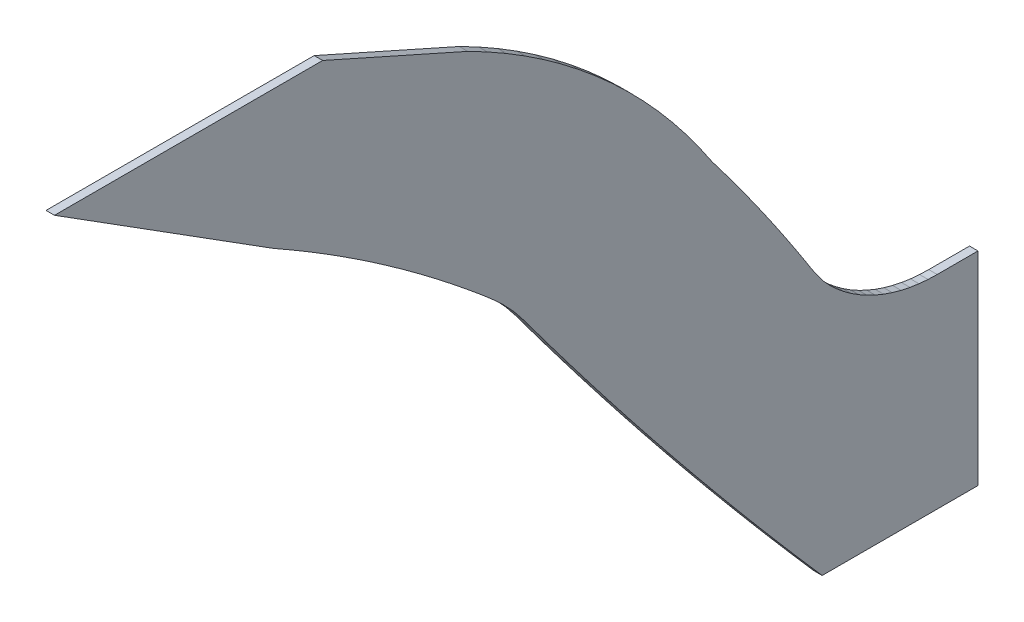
ISO-10303-21;
HEADER;
FILE_DESCRIPTION(('STEP AP214'),'2;1');
FILE_NAME('part.step','',(''),(''),'','','');
FILE_SCHEMA(('AUTOMOTIVE_DESIGN { 1 0 10303 214 1 1 1 1 }'));
ENDSEC;
DATA;
#1=APPLICATION_CONTEXT('core data for automotive mechanical design processes');
#2=APPLICATION_PROTOCOL_DEFINITION('international standard','automotive_design',2000,#1);
#3=PRODUCT_CONTEXT('',#1,'mechanical');
#4=PRODUCT('Part','Part','',(#3));
#5=PRODUCT_RELATED_PRODUCT_CATEGORY('part','',(#4));
#6=PRODUCT_DEFINITION_FORMATION('','',#4);
#7=PRODUCT_DEFINITION_CONTEXT('part definition',#1,'design');
#8=PRODUCT_DEFINITION('design','',#6,#7);
#9=PRODUCT_DEFINITION_SHAPE('','',#8);
#10=(LENGTH_UNIT() NAMED_UNIT(*) SI_UNIT(.MILLI.,.METRE.));
#11=(NAMED_UNIT(*) PLANE_ANGLE_UNIT() SI_UNIT($,.RADIAN.));
#12=(NAMED_UNIT(*) SI_UNIT($,.STERADIAN.) SOLID_ANGLE_UNIT());
#13=UNCERTAINTY_MEASURE_WITH_UNIT(LENGTH_MEASURE(1.E-05),#10,'distance_accuracy_value','');
#14=(GEOMETRIC_REPRESENTATION_CONTEXT(3) GLOBAL_UNCERTAINTY_ASSIGNED_CONTEXT((#13)) GLOBAL_UNIT_ASSIGNED_CONTEXT((#10,
#11,#12)) REPRESENTATION_CONTEXT('',''));
#15=CARTESIAN_POINT('',(0.,0.,0.));
#16=DIRECTION('',(0.,0.,1.));
#17=DIRECTION('',(1.,0.,0.));
#18=AXIS2_PLACEMENT_3D('',#15,#16,#17);
#19=CARTESIAN_POINT('',(2142.003069,-1622.249365,209.820718));
#20=DIRECTION('',(0.,-0.656734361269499,0.754121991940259));
#21=DIRECTION('',(0.,-0.754121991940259,-0.656734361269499));
#22=AXIS2_PLACEMENT_3D('',#19,#20,#21);
#23=PLANE('',#22);
#24=DIRECTION('',(0.,0.754121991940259,0.656734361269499));
#25=VECTOR('',#24,1.);
#26=CARTESIAN_POINT('',(2132.003069,-1622.249365,209.820718));
#27=LINE('',#26,#25);
#28=CARTESIAN_POINT('',(2132.003069,-1651.829004,184.061006));
#29=VERTEX_POINT('',#28);
#30=CARTESIAN_POINT('',(2132.003069,-1622.249365,209.820718));
#31=VERTEX_POINT('',#30);
#32=EDGE_CURVE('E797',#29,#31,#27,.T.);
#33=ORIENTED_EDGE('',*,*,#32,.F.);
#34=DIRECTION('',(-1.,0.,0.));
#35=VECTOR('',#34,1.);
#36=CARTESIAN_POINT('',(2142.003069,-1651.829004,184.061006));
#37=LINE('',#36,#35);
#38=CARTESIAN_POINT('',(2142.003069,-1651.829004,184.061006));
#39=VERTEX_POINT('',#38);
#40=EDGE_CURVE('E569',#39,#29,#37,.T.);
#41=ORIENTED_EDGE('',*,*,#40,.F.);
#42=DIRECTION('',(0.,0.754121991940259,0.656734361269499));
#43=VECTOR('',#42,1.);
#44=CARTESIAN_POINT('',(2142.003069,-1622.249365,209.820718));
#45=LINE('',#44,#43);
#46=CARTESIAN_POINT('',(2142.003069,-1622.249365,209.820718));
#47=VERTEX_POINT('',#46);
#48=EDGE_CURVE('E563',#39,#47,#45,.T.);
#49=ORIENTED_EDGE('',*,*,#48,.T.);
#50=DIRECTION('',(-1.,0.,0.));
#51=VECTOR('',#50,1.);
#52=CARTESIAN_POINT('',(2142.003069,-1622.249365,209.820718));
#53=LINE('',#52,#51);
#54=EDGE_CURVE('E546',#47,#31,#53,.T.);
#55=ORIENTED_EDGE('',*,*,#54,.T.);
#56=EDGE_LOOP('',(#33,#41,#49,#55));
#57=FACE_BOUND('',#56,.T.);
#58=ADVANCED_FACE('F36',(#57),#23,.T.);
#59=CARTESIAN_POINT('',(2142.003069,-1651.829004,184.061006));
#60=DIRECTION('',(0.,-0.999999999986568,5.18306414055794E-06));
#61=DIRECTION('',(0.,-5.18306414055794E-06,-0.999999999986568));
#62=AXIS2_PLACEMENT_3D('',#59,#60,#61);
#63=PLANE('',#62);
#64=DIRECTION('',(0.,5.18306414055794E-06,0.999999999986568));
#65=VECTOR('',#64,1.);
#66=CARTESIAN_POINT('',(2132.003069,-1651.829004,184.061006));
#67=LINE('',#66,#65);
#68=CARTESIAN_POINT('',(2132.003069,-1651.829958,0.));
#69=VERTEX_POINT('',#68);
#70=EDGE_CURVE('E570',#69,#29,#67,.T.);
#71=ORIENTED_EDGE('',*,*,#70,.F.);
#72=DIRECTION('',(-1.,0.,0.));
#73=VECTOR('',#72,1.);
#74=CARTESIAN_POINT('',(2142.003069,-1651.829958,0.));
#75=LINE('',#74,#73);
#76=CARTESIAN_POINT('',(2142.003069,-1651.829958,0.));
#77=VERTEX_POINT('',#76);
#78=EDGE_CURVE('E1022',#77,#69,#75,.T.);
#79=ORIENTED_EDGE('',*,*,#78,.F.);
#80=DIRECTION('',(0.,5.18306414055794E-06,0.999999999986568));
#81=VECTOR('',#80,1.);
#82=CARTESIAN_POINT('',(2142.003069,-1651.829004,184.061006));
#83=LINE('',#82,#81);
#84=EDGE_CURVE('E557',#77,#39,#83,.T.);
#85=ORIENTED_EDGE('',*,*,#84,.T.);
#86=ORIENTED_EDGE('',*,*,#40,.T.);
#87=EDGE_LOOP('',(#71,#79,#85,#86));
#88=FACE_BOUND('',#87,.T.);
#89=ADVANCED_FACE('F1393',(#88),#63,.T.);
#90=CARTESIAN_POINT('',(2142.003069,-1411.829948,0.));
#91=DIRECTION('',(0.,0.,-1.));
#92=DIRECTION('',(-1.,0.,0.));
#93=AXIS2_PLACEMENT_3D('',#90,#91,#92);
#94=PLANE('',#93);
#95=DIRECTION('',(0.,-1.,0.));
#96=VECTOR('',#95,1.);
#97=CARTESIAN_POINT('',(2132.003069,-1411.829948,0.));
#98=LINE('',#97,#96);
#99=CARTESIAN_POINT('',(2132.003069,-1411.829948,0.));
#100=VERTEX_POINT('',#99);
#101=EDGE_CURVE('E573',#100,#69,#98,.T.);
#102=ORIENTED_EDGE('',*,*,#101,.F.);
#103=DIRECTION('',(-1.,0.,0.));
#104=VECTOR('',#103,1.);
#105=CARTESIAN_POINT('',(2142.003069,-1411.829948,0.));
#106=LINE('',#105,#104);
#107=CARTESIAN_POINT('',(2142.003069,-1411.829948,0.));
#108=VERTEX_POINT('',#107);
#109=EDGE_CURVE('E1024',#108,#100,#106,.T.);
#110=ORIENTED_EDGE('',*,*,#109,.F.);
#111=DIRECTION('',(0.,-1.,0.));
#112=VECTOR('',#111,1.);
#113=CARTESIAN_POINT('',(2142.003069,-1411.829948,0.));
#114=LINE('',#113,#112);
#115=EDGE_CURVE('E793',#108,#77,#114,.T.);
#116=ORIENTED_EDGE('',*,*,#115,.T.);
#117=ORIENTED_EDGE('',*,*,#78,.T.);
#118=EDGE_LOOP('',(#102,#110,#116,#117));
#119=FACE_BOUND('',#118,.T.);
#120=ADVANCED_FACE('F1527',(#119),#94,.T.);
#121=CARTESIAN_POINT('',(2142.003069,-1411.829948,0.));
#122=DIRECTION('',(0.,1.,0.));
#123=DIRECTION('',(0.,0.,1.));
#124=AXIS2_PLACEMENT_3D('',#121,#122,#123);
#125=PLANE('',#124);
#126=DIRECTION('',(0.,0.,-1.));
#127=VECTOR('',#126,1.);
#128=CARTESIAN_POINT('',(2132.003069,-1411.829948,0.));
#129=LINE('',#128,#127);
#130=CARTESIAN_POINT('',(2132.003069,-1411.829948,48.177999));
#131=VERTEX_POINT('',#130);
#132=EDGE_CURVE('E1015',#131,#100,#129,.T.);
#133=ORIENTED_EDGE('',*,*,#132,.F.);
#134=DIRECTION('',(-1.,0.,0.));
#135=VECTOR('',#134,1.);
#136=CARTESIAN_POINT('',(2142.003069,-1411.829948,48.177999));
#137=LINE('',#136,#135);
#138=CARTESIAN_POINT('',(2142.003069,-1411.829948,48.177999));
#139=VERTEX_POINT('',#138);
#140=EDGE_CURVE('E1026',#139,#131,#137,.T.);
#141=ORIENTED_EDGE('',*,*,#140,.F.);
#142=DIRECTION('',(0.,0.,-1.));
#143=VECTOR('',#142,1.);
#144=CARTESIAN_POINT('',(2142.003069,-1411.829948,0.));
#145=LINE('',#144,#143);
#146=EDGE_CURVE('E790',#139,#108,#145,.T.);
#147=ORIENTED_EDGE('',*,*,#146,.T.);
#148=ORIENTED_EDGE('',*,*,#109,.T.);
#149=EDGE_LOOP('',(#133,#141,#147,#148));
#150=FACE_BOUND('',#149,.T.);
#151=ADVANCED_FACE('F1400',(#150),#125,.T.);
#152=CARTESIAN_POINT('',(2142.003069,-1411.829948,48.177999));
#153=DIRECTION('',(0.,0.999552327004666,-0.0299189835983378));
#154=DIRECTION('',(0.,0.0299189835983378,0.999552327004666));
#155=AXIS2_PLACEMENT_3D('',#152,#153,#154);
#156=PLANE('',#155);
#157=DIRECTION('',(0.,-0.0299189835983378,-0.999552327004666));
#158=VECTOR('',#157,1.);
#159=CARTESIAN_POINT('',(2132.003069,-1411.829948,48.177999));
#160=LINE('',#159,#158);
#161=CARTESIAN_POINT('',(2132.003069,-1411.507607,58.946971));
#162=VERTEX_POINT('',#161);
#163=EDGE_CURVE('E1012',#162,#131,#160,.T.);
#164=ORIENTED_EDGE('',*,*,#163,.F.);
#165=DIRECTION('',(-1.,0.,0.));
#166=VECTOR('',#165,1.);
#167=CARTESIAN_POINT('',(2142.003069,-1411.507607,58.946971));
#168=LINE('',#167,#166);
#169=CARTESIAN_POINT('',(2142.003069,-1411.507607,58.946971));
#170=VERTEX_POINT('',#169);
#171=EDGE_CURVE('E1028',#170,#162,#168,.T.);
#172=ORIENTED_EDGE('',*,*,#171,.F.);
#173=DIRECTION('',(0.,-0.0299189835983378,-0.999552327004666));
#174=VECTOR('',#173,1.);
#175=CARTESIAN_POINT('',(2142.003069,-1411.829948,48.177999));
#176=LINE('',#175,#174);
#177=EDGE_CURVE('E787',#170,#139,#176,.T.);
#178=ORIENTED_EDGE('',*,*,#177,.T.);
#179=ORIENTED_EDGE('',*,*,#140,.T.);
#180=EDGE_LOOP('',(#164,#172,#178,#179));
#181=FACE_BOUND('',#180,.T.);
#182=ADVANCED_FACE('F1403',(#181),#156,.T.);
#183=CARTESIAN_POINT('',(2142.003069,-1410.541415,69.677331));
#184=DIRECTION('',(0.,0.99597062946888,-0.0896800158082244));
#185=DIRECTION('',(0.,0.0896800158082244,0.99597062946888));
#186=AXIS2_PLACEMENT_3D('',#183,#184,#185);
#187=PLANE('',#186);
#188=DIRECTION('',(0.,-0.0896800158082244,-0.99597062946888));
#189=VECTOR('',#188,1.);
#190=CARTESIAN_POINT('',(2132.003069,-1410.541415,69.677331));
#191=LINE('',#190,#189);
#192=CARTESIAN_POINT('',(2132.003069,-1410.541415,69.677331));
#193=VERTEX_POINT('',#192);
#194=EDGE_CURVE('E1009',#193,#162,#191,.T.);
#195=ORIENTED_EDGE('',*,*,#194,.F.);
#196=DIRECTION('',(-1.,0.,0.));
#197=VECTOR('',#196,1.);
#198=CARTESIAN_POINT('',(2142.003069,-1410.541415,69.677331));
#199=LINE('',#198,#197);
#200=CARTESIAN_POINT('',(2142.003069,-1410.541415,69.677331));
#201=VERTEX_POINT('',#200);
#202=EDGE_CURVE('E1030',#201,#193,#199,.T.);
#203=ORIENTED_EDGE('',*,*,#202,.F.);
#204=DIRECTION('',(0.,-0.0896800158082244,-0.99597062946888));
#205=VECTOR('',#204,1.);
#206=CARTESIAN_POINT('',(2142.003069,-1410.541415,69.677331));
#207=LINE('',#206,#205);
#208=EDGE_CURVE('E784',#201,#170,#207,.T.);
#209=ORIENTED_EDGE('',*,*,#208,.T.);
#210=ORIENTED_EDGE('',*,*,#171,.T.);
#211=EDGE_LOOP('',(#195,#203,#209,#210));
#212=FACE_BOUND('',#211,.T.);
#213=ADVANCED_FACE('F1408',(#212),#187,.T.);
#214=CARTESIAN_POINT('',(2142.003069,-1410.541415,69.677331));
#215=DIRECTION('',(0.,0.988822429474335,-0.14909796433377));
#216=DIRECTION('',(0.,0.14909796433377,0.988822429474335));
#217=AXIS2_PLACEMENT_3D('',#214,#215,#216);
#218=PLANE('',#217);
#219=DIRECTION('',(0.,-0.14909796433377,-0.988822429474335));
#220=VECTOR('',#219,1.);
#221=CARTESIAN_POINT('',(2132.003069,-1410.541415,69.677331));
#222=LINE('',#221,#220);
#223=CARTESIAN_POINT('',(2132.003069,-1408.93507,80.330662));
#224=VERTEX_POINT('',#223);
#225=EDGE_CURVE('E1006',#224,#193,#222,.T.);
#226=ORIENTED_EDGE('',*,*,#225,.F.);
#227=DIRECTION('',(-1.,0.,0.));
#228=VECTOR('',#227,1.);
#229=CARTESIAN_POINT('',(2142.003069,-1408.93507,80.330662));
#230=LINE('',#229,#228);
#231=CARTESIAN_POINT('',(2142.003069,-1408.93507,80.330662));
#232=VERTEX_POINT('',#231);
#233=EDGE_CURVE('E1032',#232,#224,#230,.T.);
#234=ORIENTED_EDGE('',*,*,#233,.F.);
#235=DIRECTION('',(0.,-0.14909796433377,-0.988822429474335));
#236=VECTOR('',#235,1.);
#237=CARTESIAN_POINT('',(2142.003069,-1410.541415,69.677331));
#238=LINE('',#237,#236);
#239=EDGE_CURVE('E781',#232,#201,#238,.T.);
#240=ORIENTED_EDGE('',*,*,#239,.T.);
#241=ORIENTED_EDGE('',*,*,#202,.T.);
#242=EDGE_LOOP('',(#226,#234,#240,#241));
#243=FACE_BOUND('',#242,.T.);
#244=ADVANCED_FACE('F1411',(#243),#218,.T.);
#245=CARTESIAN_POINT('',(2142.003069,-1406.694293,90.868816));
#246=DIRECTION('',(0.,0.978132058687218,-0.207984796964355));
#247=DIRECTION('',(0.,0.207984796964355,0.978132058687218));
#248=AXIS2_PLACEMENT_3D('',#245,#246,#247);
#249=PLANE('',#248);
#250=DIRECTION('',(0.,-0.207984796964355,-0.978132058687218));
#251=VECTOR('',#250,1.);
#252=CARTESIAN_POINT('',(2132.003069,-1406.694293,90.868816));
#253=LINE('',#252,#251);
#254=CARTESIAN_POINT('',(2132.003069,-1406.694293,90.868816));
#255=VERTEX_POINT('',#254);
#256=EDGE_CURVE('E1003',#255,#224,#253,.T.);
#257=ORIENTED_EDGE('',*,*,#256,.F.);
#258=DIRECTION('',(-1.,0.,0.));
#259=VECTOR('',#258,1.);
#260=CARTESIAN_POINT('',(2142.003069,-1406.694293,90.868816));
#261=LINE('',#260,#259);
#262=CARTESIAN_POINT('',(2142.003069,-1406.694293,90.868816));
#263=VERTEX_POINT('',#262);
#264=EDGE_CURVE('E1034',#263,#255,#261,.T.);
#265=ORIENTED_EDGE('',*,*,#264,.F.);
#266=DIRECTION('',(0.,-0.207984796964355,-0.978132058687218));
#267=VECTOR('',#266,1.);
#268=CARTESIAN_POINT('',(2142.003069,-1406.694293,90.868816));
#269=LINE('',#268,#267);
#270=EDGE_CURVE('E778',#263,#232,#269,.T.);
#271=ORIENTED_EDGE('',*,*,#270,.T.);
#272=ORIENTED_EDGE('',*,*,#233,.T.);
#273=EDGE_LOOP('',(#257,#265,#271,#272));
#274=FACE_BOUND('',#273,.T.);
#275=ADVANCED_FACE('F1416',(#274),#249,.T.);
#276=CARTESIAN_POINT('',(2142.003069,-1403.826952,101.254024));
#277=DIRECTION('',(0.,0.963934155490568,-0.266140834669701));
#278=DIRECTION('',(0.,0.266140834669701,0.963934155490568));
#279=AXIS2_PLACEMENT_3D('',#276,#277,#278);
#280=PLANE('',#279);
#281=DIRECTION('',(0.,-0.266140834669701,-0.963934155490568));
#282=VECTOR('',#281,1.);
#283=CARTESIAN_POINT('',(2132.003069,-1403.826952,101.254024));
#284=LINE('',#283,#282);
#285=CARTESIAN_POINT('',(2132.003069,-1403.826952,101.254024));
#286=VERTEX_POINT('',#285);
#287=EDGE_CURVE('E1000',#286,#255,#284,.T.);
#288=ORIENTED_EDGE('',*,*,#287,.F.);
#289=DIRECTION('',(-1.,0.,0.));
#290=VECTOR('',#289,1.);
#291=CARTESIAN_POINT('',(2142.003069,-1403.826952,101.254024));
#292=LINE('',#291,#290);
#293=CARTESIAN_POINT('',(2142.003069,-1403.826952,101.254024));
#294=VERTEX_POINT('',#293);
#295=EDGE_CURVE('E1036',#294,#286,#292,.T.);
#296=ORIENTED_EDGE('',*,*,#295,.F.);
#297=DIRECTION('',(0.,-0.266140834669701,-0.963934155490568));
#298=VECTOR('',#297,1.);
#299=CARTESIAN_POINT('',(2142.003069,-1403.826952,101.254024));
#300=LINE('',#299,#298);
#301=EDGE_CURVE('E775',#294,#263,#300,.T.);
#302=ORIENTED_EDGE('',*,*,#301,.T.);
#303=ORIENTED_EDGE('',*,*,#264,.T.);
#304=EDGE_LOOP('',(#288,#296,#302,#303));
#305=FACE_BOUND('',#304,.T.);
#306=ADVANCED_FACE('F1419',(#305),#280,.T.);
#307=CARTESIAN_POINT('',(2142.003069,-1400.343537,111.449085));
#308=DIRECTION('',(0.,0.946288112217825,-0.323324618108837));
#309=DIRECTION('',(0.,0.323324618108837,0.946288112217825));
#310=AXIS2_PLACEMENT_3D('',#307,#308,#309);
#311=PLANE('',#310);
#312=DIRECTION('',(0.,-0.323324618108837,-0.946288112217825));
#313=VECTOR('',#312,1.);
#314=CARTESIAN_POINT('',(2132.003069,-1400.343537,111.449085));
#315=LINE('',#314,#313);
#316=CARTESIAN_POINT('',(2132.003069,-1400.343537,111.449085));
#317=VERTEX_POINT('',#316);
#318=EDGE_CURVE('E997',#317,#286,#315,.T.);
#319=ORIENTED_EDGE('',*,*,#318,.F.);
#320=DIRECTION('',(-1.,0.,0.));
#321=VECTOR('',#320,1.);
#322=CARTESIAN_POINT('',(2142.003069,-1400.343537,111.449085));
#323=LINE('',#322,#321);
#324=CARTESIAN_POINT('',(2142.003069,-1400.343537,111.449085));
#325=VERTEX_POINT('',#324);
#326=EDGE_CURVE('E1038',#325,#317,#323,.T.);
#327=ORIENTED_EDGE('',*,*,#326,.F.);
#328=DIRECTION('',(0.,-0.323324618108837,-0.946288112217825));
#329=VECTOR('',#328,1.);
#330=CARTESIAN_POINT('',(2142.003069,-1400.343537,111.449085));
#331=LINE('',#330,#329);
#332=EDGE_CURVE('E772',#325,#294,#331,.T.);
#333=ORIENTED_EDGE('',*,*,#332,.T.);
#334=ORIENTED_EDGE('',*,*,#295,.T.);
#335=EDGE_LOOP('',(#319,#327,#333,#334));
#336=FACE_BOUND('',#335,.T.);
#337=ADVANCED_FACE('F1424',(#336),#311,.T.);
#338=CARTESIAN_POINT('',(2142.003069,-1400.343537,111.449085));
#339=DIRECTION('',(0.,0.925246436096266,-0.379366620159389));
#340=DIRECTION('',(0.,0.37936662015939,0.925246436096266));
#341=AXIS2_PLACEMENT_3D('',#338,#339,#340);
#342=PLANE('',#341);
#343=DIRECTION('',(0.,-0.379366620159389,-0.925246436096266));
#344=VECTOR('',#343,1.);
#345=CARTESIAN_POINT('',(2132.003069,-1400.343537,111.449085));
#346=LINE('',#345,#344);
#347=CARTESIAN_POINT('',(2132.003069,-1396.256328,121.417478));
#348=VERTEX_POINT('',#347);
#349=EDGE_CURVE('E994',#348,#317,#346,.T.);
#350=ORIENTED_EDGE('',*,*,#349,.F.);
#351=DIRECTION('',(-1.,0.,0.));
#352=VECTOR('',#351,1.);
#353=CARTESIAN_POINT('',(2142.003069,-1396.256328,121.417478));
#354=LINE('',#353,#352);
#355=CARTESIAN_POINT('',(2142.003069,-1396.256328,121.417478));
#356=VERTEX_POINT('',#355);
#357=EDGE_CURVE('E1040',#356,#348,#354,.T.);
#358=ORIENTED_EDGE('',*,*,#357,.F.);
#359=DIRECTION('',(0.,-0.379366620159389,-0.925246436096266));
#360=VECTOR('',#359,1.);
#361=CARTESIAN_POINT('',(2142.003069,-1400.343537,111.449085));
#362=LINE('',#361,#360);
#363=EDGE_CURVE('E769',#356,#325,#362,.T.);
#364=ORIENTED_EDGE('',*,*,#363,.T.);
#365=ORIENTED_EDGE('',*,*,#326,.T.);
#366=EDGE_LOOP('',(#350,#358,#364,#365));
#367=FACE_BOUND('',#366,.T.);
#368=ADVANCED_FACE('F1427',(#367),#342,.T.);
#369=CARTESIAN_POINT('',(2142.003069,-1391.580105,131.123498));
#370=DIRECTION('',(0.,0.90089446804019,-0.43403819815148));
#371=DIRECTION('',(0.,0.43403819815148,0.90089446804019));
#372=AXIS2_PLACEMENT_3D('',#369,#370,#371);
#373=PLANE('',#372);
#374=DIRECTION('',(0.,-0.43403819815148,-0.90089446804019));
#375=VECTOR('',#374,1.);
#376=CARTESIAN_POINT('',(2132.003069,-1391.580105,131.123498));
#377=LINE('',#376,#375);
#378=CARTESIAN_POINT('',(2132.003069,-1391.580105,131.123498));
#379=VERTEX_POINT('',#378);
#380=EDGE_CURVE('E991',#379,#348,#377,.T.);
#381=ORIENTED_EDGE('',*,*,#380,.F.);
#382=DIRECTION('',(-1.,0.,0.));
#383=VECTOR('',#382,1.);
#384=CARTESIAN_POINT('',(2142.003069,-1391.580105,131.123498));
#385=LINE('',#384,#383);
#386=CARTESIAN_POINT('',(2142.003069,-1391.580105,131.123498));
#387=VERTEX_POINT('',#386);
#388=EDGE_CURVE('E1042',#387,#379,#385,.T.);
#389=ORIENTED_EDGE('',*,*,#388,.F.);
#390=DIRECTION('',(0.,-0.43403819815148,-0.90089446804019));
#391=VECTOR('',#390,1.);
#392=CARTESIAN_POINT('',(2142.003069,-1391.580105,131.123498));
#393=LINE('',#392,#391);
#394=EDGE_CURVE('E766',#387,#356,#393,.T.);
#395=ORIENTED_EDGE('',*,*,#394,.T.);
#396=ORIENTED_EDGE('',*,*,#357,.T.);
#397=EDGE_LOOP('',(#381,#389,#395,#396));
#398=FACE_BOUND('',#397,.T.);
#399=ADVANCED_FACE('F1432',(#398),#373,.T.);
#400=CARTESIAN_POINT('',(2142.003069,-1386.331558,140.532345));
#401=DIRECTION('',(0.,0.873312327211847,-0.487160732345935));
#402=DIRECTION('',(0.,0.487160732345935,0.873312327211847));
#403=AXIS2_PLACEMENT_3D('',#400,#401,#402);
#404=PLANE('',#403);
#405=DIRECTION('',(0.,-0.487160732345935,-0.873312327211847));
#406=VECTOR('',#405,1.);
#407=CARTESIAN_POINT('',(2132.003069,-1386.331558,140.532345));
#408=LINE('',#407,#406);
#409=CARTESIAN_POINT('',(2132.003069,-1386.331558,140.532345));
#410=VERTEX_POINT('',#409);
#411=EDGE_CURVE('E988',#410,#379,#408,.T.);
#412=ORIENTED_EDGE('',*,*,#411,.F.);
#413=DIRECTION('',(-1.,0.,0.));
#414=VECTOR('',#413,1.);
#415=CARTESIAN_POINT('',(2142.003069,-1386.331558,140.532345));
#416=LINE('',#415,#414);
#417=CARTESIAN_POINT('',(2142.003069,-1386.331558,140.532345));
#418=VERTEX_POINT('',#417);
#419=EDGE_CURVE('E1044',#418,#410,#416,.T.);
#420=ORIENTED_EDGE('',*,*,#419,.F.);
#421=DIRECTION('',(0.,-0.487160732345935,-0.873312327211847));
#422=VECTOR('',#421,1.);
#423=CARTESIAN_POINT('',(2142.003069,-1386.331558,140.532345));
#424=LINE('',#423,#422);
#425=EDGE_CURVE('E763',#418,#387,#424,.T.);
#426=ORIENTED_EDGE('',*,*,#425,.T.);
#427=ORIENTED_EDGE('',*,*,#388,.T.);
#428=EDGE_LOOP('',(#412,#420,#426,#427));
#429=FACE_BOUND('',#428,.T.);
#430=ADVANCED_FACE('F1435',(#429),#404,.T.);
#431=CARTESIAN_POINT('',(2142.003069,-1386.331558,140.532345));
#432=DIRECTION('',(0.,0.842598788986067,-0.538541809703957));
#433=DIRECTION('',(0.,0.538541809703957,0.842598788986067));
#434=AXIS2_PLACEMENT_3D('',#431,#432,#433);
#435=PLANE('',#434);
#436=DIRECTION('',(0.,-0.538541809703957,-0.842598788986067));
#437=VECTOR('',#436,1.);
#438=CARTESIAN_POINT('',(2132.003069,-1386.331558,140.532345));
#439=LINE('',#438,#437);
#440=CARTESIAN_POINT('',(2132.003069,-1380.529404,149.610355));
#441=VERTEX_POINT('',#440);
#442=EDGE_CURVE('E985',#441,#410,#439,.T.);
#443=ORIENTED_EDGE('',*,*,#442,.F.);
#444=DIRECTION('',(-1.,0.,0.));
#445=VECTOR('',#444,1.);
#446=CARTESIAN_POINT('',(2142.003069,-1380.529404,149.610355));
#447=LINE('',#446,#445);
#448=CARTESIAN_POINT('',(2142.003069,-1380.529404,149.610355));
#449=VERTEX_POINT('',#448);
#450=EDGE_CURVE('E1046',#449,#441,#447,.T.);
#451=ORIENTED_EDGE('',*,*,#450,.F.);
#452=DIRECTION('',(0.,-0.538541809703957,-0.842598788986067));
#453=VECTOR('',#452,1.);
#454=CARTESIAN_POINT('',(2142.003069,-1386.331558,140.532345));
#455=LINE('',#454,#453);
#456=EDGE_CURVE('E760',#449,#418,#455,.T.);
#457=ORIENTED_EDGE('',*,*,#456,.T.);
#458=ORIENTED_EDGE('',*,*,#419,.T.);
#459=EDGE_LOOP('',(#443,#451,#457,#458));
#460=FACE_BOUND('',#459,.T.);
#461=ADVANCED_FACE('F1440',(#460),#435,.T.);
#462=CARTESIAN_POINT('',(2142.003069,-1380.529404,149.610355));
#463=DIRECTION('',(0.,0.808873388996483,-0.587982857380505));
#464=DIRECTION('',(0.,0.587982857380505,0.808873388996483));
#465=AXIS2_PLACEMENT_3D('',#462,#463,#464);
#466=PLANE('',#465);
#467=DIRECTION('',(0.,-0.587982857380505,-0.808873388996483));
#468=VECTOR('',#467,1.);
#469=CARTESIAN_POINT('',(2132.003069,-1380.529404,149.610355));
#470=LINE('',#469,#468);
#471=CARTESIAN_POINT('',(2132.003069,-1374.194622,158.324957));
#472=VERTEX_POINT('',#471);
#473=EDGE_CURVE('E982',#472,#441,#470,.T.);
#474=ORIENTED_EDGE('',*,*,#473,.F.);
#475=DIRECTION('',(-1.,0.,0.));
#476=VECTOR('',#475,1.);
#477=CARTESIAN_POINT('',(2142.003069,-1374.194622,158.324957));
#478=LINE('',#477,#476);
#479=CARTESIAN_POINT('',(2142.003069,-1374.194622,158.324957));
#480=VERTEX_POINT('',#479);
#481=EDGE_CURVE('E1048',#480,#472,#478,.T.);
#482=ORIENTED_EDGE('',*,*,#481,.F.);
#483=DIRECTION('',(0.,-0.587982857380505,-0.808873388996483));
#484=VECTOR('',#483,1.);
#485=CARTESIAN_POINT('',(2142.003069,-1380.529404,149.610355));
#486=LINE('',#485,#484);
#487=EDGE_CURVE('E757',#480,#449,#486,.T.);
#488=ORIENTED_EDGE('',*,*,#487,.T.);
#489=ORIENTED_EDGE('',*,*,#450,.T.);
#490=EDGE_LOOP('',(#474,#482,#488,#489));
#491=FACE_BOUND('',#490,.T.);
#492=ADVANCED_FACE('F1443',(#491),#466,.T.);
#493=CARTESIAN_POINT('',(2142.003069,-1367.349863,166.644976));
#494=DIRECTION('',(0.,0.772249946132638,-0.635318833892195));
#495=DIRECTION('',(0.,0.635318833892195,0.772249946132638));
#496=AXIS2_PLACEMENT_3D('',#493,#494,#495);
#497=PLANE('',#496);
#498=DIRECTION('',(0.,-0.635318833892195,-0.772249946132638));
#499=VECTOR('',#498,1.);
#500=CARTESIAN_POINT('',(2132.003069,-1367.349863,166.644976));
#501=LINE('',#500,#499);
#502=CARTESIAN_POINT('',(2132.003069,-1367.349863,166.644976));
#503=VERTEX_POINT('',#502);
#504=EDGE_CURVE('E979',#503,#472,#501,.T.);
#505=ORIENTED_EDGE('',*,*,#504,.F.);
#506=DIRECTION('',(-1.,0.,0.));
#507=VECTOR('',#506,1.);
#508=CARTESIAN_POINT('',(2142.003069,-1367.349863,166.644976));
#509=LINE('',#508,#507);
#510=CARTESIAN_POINT('',(2142.003069,-1367.349863,166.644976));
#511=VERTEX_POINT('',#510);
#512=EDGE_CURVE('E1050',#511,#503,#509,.T.);
#513=ORIENTED_EDGE('',*,*,#512,.F.);
#514=DIRECTION('',(0.,-0.635318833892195,-0.772249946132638));
#515=VECTOR('',#514,1.);
#516=CARTESIAN_POINT('',(2142.003069,-1367.349863,166.644976));
#517=LINE('',#516,#515);
#518=EDGE_CURVE('E754',#511,#480,#517,.T.);
#519=ORIENTED_EDGE('',*,*,#518,.T.);
#520=ORIENTED_EDGE('',*,*,#481,.T.);
#521=EDGE_LOOP('',(#505,#513,#519,#520));
#522=FACE_BOUND('',#521,.T.);
#523=ADVANCED_FACE('F1448',(#522),#497,.T.);
#524=CARTESIAN_POINT('',(2142.003069,-1360.019565,174.540564));
#525=DIRECTION('',(0.,0.732854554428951,-0.680385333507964));
#526=DIRECTION('',(0.,0.680385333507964,0.732854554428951));
#527=AXIS2_PLACEMENT_3D('',#524,#525,#526);
#528=PLANE('',#527);
#529=DIRECTION('',(0.,-0.680385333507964,-0.732854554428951));
#530=VECTOR('',#529,1.);
#531=CARTESIAN_POINT('',(2132.003069,-1360.019565,174.540564));
#532=LINE('',#531,#530);
#533=CARTESIAN_POINT('',(2132.003069,-1360.019565,174.540564));
#534=VERTEX_POINT('',#533);
#535=EDGE_CURVE('E976',#534,#503,#532,.T.);
#536=ORIENTED_EDGE('',*,*,#535,.F.);
#537=DIRECTION('',(-1.,0.,0.));
#538=VECTOR('',#537,1.);
#539=CARTESIAN_POINT('',(2142.003069,-1360.019565,174.540564));
#540=LINE('',#539,#538);
#541=CARTESIAN_POINT('',(2142.003069,-1360.019565,174.540564));
#542=VERTEX_POINT('',#541);
#543=EDGE_CURVE('E1052',#542,#534,#540,.T.);
#544=ORIENTED_EDGE('',*,*,#543,.F.);
#545=DIRECTION('',(0.,-0.680385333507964,-0.732854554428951));
#546=VECTOR('',#545,1.);
#547=CARTESIAN_POINT('',(2142.003069,-1360.019565,174.540564));
#548=LINE('',#547,#546);
#549=EDGE_CURVE('E751',#542,#511,#548,.T.);
#550=ORIENTED_EDGE('',*,*,#549,.T.);
#551=ORIENTED_EDGE('',*,*,#512,.T.);
#552=EDGE_LOOP('',(#536,#544,#550,#551));
#553=FACE_BOUND('',#552,.T.);
#554=ADVANCED_FACE('F1451',(#553),#528,.T.);
#555=CARTESIAN_POINT('',(2142.003069,-1360.019565,174.540564));
#556=DIRECTION('',(0.,0.690833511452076,-0.723013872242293));
#557=DIRECTION('',(0.,0.723013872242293,0.690833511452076));
#558=AXIS2_PLACEMENT_3D('',#555,#556,#557);
#559=PLANE('',#558);
#560=DIRECTION('',(0.,-0.723013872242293,-0.690833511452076));
#561=VECTOR('',#560,1.);
#562=CARTESIAN_POINT('',(2132.003069,-1360.019565,174.540564));
#563=LINE('',#562,#561);
#564=CARTESIAN_POINT('',(2132.003069,-1357.64164342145,176.812647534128));
#565=VERTEX_POINT('',#564);
#566=EDGE_CURVE('E974',#565,#534,#563,.T.);
#567=ORIENTED_EDGE('',*,*,#566,.F.);
#568=DIRECTION('',(-1.,0.,0.));
#569=VECTOR('',#568,1.);
#570=CARTESIAN_POINT('',(2142.003069,-1357.64164342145,176.812647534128));
#571=LINE('',#570,#569);
#572=CARTESIAN_POINT('',(2142.003069,-1357.64164342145,176.812647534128));
#573=VERTEX_POINT('',#572);
#574=EDGE_CURVE('E1021',#565,#573,#571,.F.);
#575=ORIENTED_EDGE('',*,*,#574,.T.);
#576=DIRECTION('',(0.,-0.723013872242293,-0.690833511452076));
#577=VECTOR('',#576,1.);
#578=CARTESIAN_POINT('',(2142.003069,-1360.019565,174.540564));
#579=LINE('',#578,#577);
#580=EDGE_CURVE('E749',#573,#542,#579,.T.);
#581=ORIENTED_EDGE('',*,*,#580,.T.);
#582=ORIENTED_EDGE('',*,*,#543,.T.);
#583=EDGE_LOOP('',(#567,#575,#581,#582));
#584=FACE_BOUND('',#583,.T.);
#585=ADVANCED_FACE('F1455',(#584),#559,.T.);
#586=CARTESIAN_POINT('',(2142.003069,-1319.21339,204.693645));
#587=DIRECTION('',(0.,0.538751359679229,-0.842464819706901));
#588=DIRECTION('',(0.,0.842464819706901,0.538751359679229));
#589=AXIS2_PLACEMENT_3D('',#586,#587,#588);
#590=PLANE('',#589);
#591=DIRECTION('',(0.,-0.842464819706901,-0.538751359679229));
#592=VECTOR('',#591,1.);
#593=CARTESIAN_POINT('',(2142.003069,-1319.21339,204.693645));
#594=LINE('',#593,#592);
#595=CARTESIAN_POINT('',(2142.003069,-1319.21339,204.693645));
#596=VERTEX_POINT('',#595);
#597=CARTESIAN_POINT('',(2142.003069,-1330.42520477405,197.523754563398));
#598=VERTEX_POINT('',#597);
#599=EDGE_CURVE('E746',#596,#598,#594,.T.);
#600=ORIENTED_EDGE('',*,*,#599,.T.);
#601=DIRECTION('',(-1.,0.,0.));
#602=VECTOR('',#601,1.);
#603=CARTESIAN_POINT('',(2132.003069,-1330.42520477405,197.523754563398));
#604=LINE('',#603,#602);
#605=CARTESIAN_POINT('',(2132.003069,-1330.42520477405,197.523754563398));
#606=VERTEX_POINT('',#605);
#607=EDGE_CURVE('E1172',#598,#606,#604,.T.);
#608=ORIENTED_EDGE('',*,*,#607,.T.);
#609=DIRECTION('',(0.,-0.842464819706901,-0.538751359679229));
#610=VECTOR('',#609,1.);
#611=CARTESIAN_POINT('',(2132.003069,-1319.21339,204.693645));
#612=LINE('',#611,#610);
#613=CARTESIAN_POINT('',(2132.003069,-1319.21339,204.693645));
#614=VERTEX_POINT('',#613);
#615=EDGE_CURVE('E972',#614,#606,#612,.T.);
#616=ORIENTED_EDGE('',*,*,#615,.F.);
#617=DIRECTION('',(-1.,0.,0.));
#618=VECTOR('',#617,1.);
#619=CARTESIAN_POINT('',(2142.003069,-1319.21339,204.693645));
#620=LINE('',#619,#618);
#621=EDGE_CURVE('E1055',#596,#614,#620,.T.);
#622=ORIENTED_EDGE('',*,*,#621,.F.);
#623=EDGE_LOOP('',(#600,#608,#616,#622));
#624=FACE_BOUND('',#623,.T.);
#625=ADVANCED_FACE('F1467',(#624),#590,.T.);
#626=CARTESIAN_POINT('',(2142.003069,-1319.21339,204.693645));
#627=DIRECTION('',(0.,0.544005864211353,-0.839081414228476));
#628=DIRECTION('',(0.,0.839081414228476,0.544005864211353));
#629=AXIS2_PLACEMENT_3D('',#626,#627,#628);
#630=PLANE('',#629);
#631=DIRECTION('',(0.,-0.839081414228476,-0.544005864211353));
#632=VECTOR('',#631,1.);
#633=CARTESIAN_POINT('',(2132.003069,-1319.21339,204.693645));
#634=LINE('',#633,#632);
#635=CARTESIAN_POINT('',(2132.003069,-1306.89013,212.683246));
#636=VERTEX_POINT('',#635);
#637=EDGE_CURVE('E969',#636,#614,#634,.T.);
#638=ORIENTED_EDGE('',*,*,#637,.F.);
#639=DIRECTION('',(-1.,0.,0.));
#640=VECTOR('',#639,1.);
#641=CARTESIAN_POINT('',(2142.003069,-1306.89013,212.683246));
#642=LINE('',#641,#640);
#643=CARTESIAN_POINT('',(2142.003069,-1306.89013,212.683246));
#644=VERTEX_POINT('',#643);
#645=EDGE_CURVE('E1057',#644,#636,#642,.T.);
#646=ORIENTED_EDGE('',*,*,#645,.F.);
#647=DIRECTION('',(0.,-0.839081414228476,-0.544005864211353));
#648=VECTOR('',#647,1.);
#649=CARTESIAN_POINT('',(2142.003069,-1319.21339,204.693645));
#650=LINE('',#649,#648);
#651=EDGE_CURVE('E743',#644,#596,#650,.T.);
#652=ORIENTED_EDGE('',*,*,#651,.T.);
#653=ORIENTED_EDGE('',*,*,#621,.T.);
#654=EDGE_LOOP('',(#638,#646,#652,#653));
#655=FACE_BOUND('',#654,.T.);
#656=ADVANCED_FACE('F1471',(#655),#630,.T.);
#657=CARTESIAN_POINT('',(2142.003069,-1306.89013,212.683246));
#658=DIRECTION('',(0.,0.549243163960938,-0.835662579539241));
#659=DIRECTION('',(0.,0.835662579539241,0.549243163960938));
#660=AXIS2_PLACEMENT_3D('',#657,#658,#659);
#661=PLANE('',#660);
#662=DIRECTION('',(0.,-0.835662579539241,-0.549243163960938));
#663=VECTOR('',#662,1.);
#664=CARTESIAN_POINT('',(2132.003069,-1306.89013,212.683246));
#665=LINE('',#664,#663);
#666=CARTESIAN_POINT('',(2132.003069,-1294.617057,220.749781));
#667=VERTEX_POINT('',#666);
#668=EDGE_CURVE('E966',#667,#636,#665,.T.);
#669=ORIENTED_EDGE('',*,*,#668,.F.);
#670=DIRECTION('',(-1.,0.,0.));
#671=VECTOR('',#670,1.);
#672=CARTESIAN_POINT('',(2142.003069,-1294.617057,220.749781));
#673=LINE('',#672,#671);
#674=CARTESIAN_POINT('',(2142.003069,-1294.617057,220.749781));
#675=VERTEX_POINT('',#674);
#676=EDGE_CURVE('E1059',#675,#667,#673,.T.);
#677=ORIENTED_EDGE('',*,*,#676,.F.);
#678=DIRECTION('',(0.,-0.835662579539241,-0.549243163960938));
#679=VECTOR('',#678,1.);
#680=CARTESIAN_POINT('',(2142.003069,-1306.89013,212.683246));
#681=LINE('',#680,#679);
#682=EDGE_CURVE('E740',#675,#644,#681,.T.);
#683=ORIENTED_EDGE('',*,*,#682,.T.);
#684=ORIENTED_EDGE('',*,*,#645,.T.);
#685=EDGE_LOOP('',(#669,#677,#683,#684));
#686=FACE_BOUND('',#685,.T.);
#687=ADVANCED_FACE('F1476',(#686),#661,.T.);
#688=CARTESIAN_POINT('',(2142.003069,-1294.617057,220.749781));
#689=DIRECTION('',(0.,0.554462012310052,-0.832209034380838));
#690=DIRECTION('',(0.,0.832209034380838,0.554462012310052));
#691=AXIS2_PLACEMENT_3D('',#688,#689,#690);
#692=PLANE('',#691);
#693=DIRECTION('',(0.,-0.832209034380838,-0.554462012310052));
#694=VECTOR('',#693,1.);
#695=CARTESIAN_POINT('',(2132.003069,-1294.617057,220.749781));
#696=LINE('',#695,#694);
#697=CARTESIAN_POINT('',(2132.003069,-1282.394767,228.892922));
#698=VERTEX_POINT('',#697);
#699=EDGE_CURVE('E963',#698,#667,#696,.T.);
#700=ORIENTED_EDGE('',*,*,#699,.F.);
#701=DIRECTION('',(-1.,0.,0.));
#702=VECTOR('',#701,1.);
#703=CARTESIAN_POINT('',(2142.003069,-1282.394767,228.892922));
#704=LINE('',#703,#702);
#705=CARTESIAN_POINT('',(2142.003069,-1282.394767,228.892922));
#706=VERTEX_POINT('',#705);
#707=EDGE_CURVE('E1061',#706,#698,#704,.T.);
#708=ORIENTED_EDGE('',*,*,#707,.F.);
#709=DIRECTION('',(0.,-0.832209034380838,-0.554462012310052));
#710=VECTOR('',#709,1.);
#711=CARTESIAN_POINT('',(2142.003069,-1294.617057,220.749781));
#712=LINE('',#711,#710);
#713=EDGE_CURVE('E737',#706,#675,#712,.T.);
#714=ORIENTED_EDGE('',*,*,#713,.T.);
#715=ORIENTED_EDGE('',*,*,#676,.T.);
#716=EDGE_LOOP('',(#700,#708,#714,#715));
#717=FACE_BOUND('',#716,.T.);
#718=ADVANCED_FACE('F1479',(#717),#692,.T.);
#719=CARTESIAN_POINT('',(2142.003069,-1282.394767,228.892922));
#720=DIRECTION('',(0.,0.559655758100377,-0.828725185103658));
#721=DIRECTION('',(0.,0.828725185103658,0.559655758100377));
#722=AXIS2_PLACEMENT_3D('',#719,#720,#721);
#723=PLANE('',#722);
#724=DIRECTION('',(0.,-0.828725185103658,-0.559655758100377));
#725=VECTOR('',#724,1.);
#726=CARTESIAN_POINT('',(2132.003069,-1282.394767,228.892922));
#727=LINE('',#726,#725);
#728=CARTESIAN_POINT('',(2132.003069,-1270.223618,237.112358));
#729=VERTEX_POINT('',#728);
#730=EDGE_CURVE('E960',#729,#698,#727,.T.);
#731=ORIENTED_EDGE('',*,*,#730,.F.);
#732=DIRECTION('',(-1.,0.,0.));
#733=VECTOR('',#732,1.);
#734=CARTESIAN_POINT('',(2142.003069,-1270.223618,237.112358));
#735=LINE('',#734,#733);
#736=CARTESIAN_POINT('',(2142.003069,-1270.223618,237.112358));
#737=VERTEX_POINT('',#736);
#738=EDGE_CURVE('E1063',#737,#729,#735,.T.);
#739=ORIENTED_EDGE('',*,*,#738,.F.);
#740=DIRECTION('',(0.,-0.828725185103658,-0.559655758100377));
#741=VECTOR('',#740,1.);
#742=CARTESIAN_POINT('',(2142.003069,-1282.394767,228.892922));
#743=LINE('',#742,#741);
#744=EDGE_CURVE('E734',#737,#706,#743,.T.);
#745=ORIENTED_EDGE('',*,*,#744,.T.);
#746=ORIENTED_EDGE('',*,*,#707,.T.);
#747=EDGE_LOOP('',(#731,#739,#745,#746));
#748=FACE_BOUND('',#747,.T.);
#749=ADVANCED_FACE('F1484',(#748),#723,.T.);
#750=CARTESIAN_POINT('',(2142.003069,-1270.223618,237.112358));
#751=DIRECTION('',(0.,0.564831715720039,-0.825206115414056));
#752=DIRECTION('',(0.,0.825206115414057,0.564831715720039));
#753=AXIS2_PLACEMENT_3D('',#750,#751,#752);
#754=PLANE('',#753);
#755=DIRECTION('',(0.,-0.825206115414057,-0.564831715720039));
#756=VECTOR('',#755,1.);
#757=CARTESIAN_POINT('',(2132.003069,-1270.223618,237.112358));
#758=LINE('',#757,#756);
#759=CARTESIAN_POINT('',(2132.003069,-1258.104205,245.407775));
#760=VERTEX_POINT('',#759);
#761=EDGE_CURVE('E957',#760,#729,#758,.T.);
#762=ORIENTED_EDGE('',*,*,#761,.F.);
#763=DIRECTION('',(-1.,0.,0.));
#764=VECTOR('',#763,1.);
#765=CARTESIAN_POINT('',(2142.003069,-1258.104205,245.407775));
#766=LINE('',#765,#764);
#767=CARTESIAN_POINT('',(2142.003069,-1258.104205,245.407775));
#768=VERTEX_POINT('',#767);
#769=EDGE_CURVE('E1065',#768,#760,#766,.T.);
#770=ORIENTED_EDGE('',*,*,#769,.F.);
#771=DIRECTION('',(0.,-0.825206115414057,-0.564831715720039));
#772=VECTOR('',#771,1.);
#773=CARTESIAN_POINT('',(2142.003069,-1270.223618,237.112358));
#774=LINE('',#773,#772);
#775=EDGE_CURVE('E731',#768,#737,#774,.T.);
#776=ORIENTED_EDGE('',*,*,#775,.T.);
#777=ORIENTED_EDGE('',*,*,#738,.T.);
#778=EDGE_LOOP('',(#762,#770,#776,#777));
#779=FACE_BOUND('',#778,.T.);
#780=ADVANCED_FACE('F1487',(#779),#754,.T.);
#781=CARTESIAN_POINT('',(2142.003069,-1258.104205,245.407775));
#782=DIRECTION('',(0.,0.569976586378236,-0.821660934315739));
#783=DIRECTION('',(0.,0.821660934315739,0.569976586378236));
#784=AXIS2_PLACEMENT_3D('',#781,#782,#783);
#785=PLANE('',#784);
#786=DIRECTION('',(0.,-0.821660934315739,-0.569976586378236));
#787=VECTOR('',#786,1.);
#788=CARTESIAN_POINT('',(2132.003069,-1258.104205,245.407775));
#789=LINE('',#788,#787);
#790=CARTESIAN_POINT('',(2132.003069,-1246.036768,253.778815));
#791=VERTEX_POINT('',#790);
#792=EDGE_CURVE('E954',#791,#760,#789,.T.);
#793=ORIENTED_EDGE('',*,*,#792,.F.);
#794=DIRECTION('',(-1.,0.,0.));
#795=VECTOR('',#794,1.);
#796=CARTESIAN_POINT('',(2142.003069,-1246.036768,253.778815));
#797=LINE('',#796,#795);
#798=CARTESIAN_POINT('',(2142.003069,-1246.036768,253.778815));
#799=VERTEX_POINT('',#798);
#800=EDGE_CURVE('E1067',#799,#791,#797,.T.);
#801=ORIENTED_EDGE('',*,*,#800,.F.);
#802=DIRECTION('',(0.,-0.821660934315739,-0.569976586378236));
#803=VECTOR('',#802,1.);
#804=CARTESIAN_POINT('',(2142.003069,-1258.104205,245.407775));
#805=LINE('',#804,#803);
#806=EDGE_CURVE('E728',#799,#768,#805,.T.);
#807=ORIENTED_EDGE('',*,*,#806,.T.);
#808=ORIENTED_EDGE('',*,*,#769,.T.);
#809=EDGE_LOOP('',(#793,#801,#807,#808));
#810=FACE_BOUND('',#809,.T.);
#811=ADVANCED_FACE('F1492',(#810),#785,.T.);
#812=CARTESIAN_POINT('',(2142.003069,-1246.036768,253.778815));
#813=DIRECTION('',(0.,0.575109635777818,-0.818076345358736));
#814=DIRECTION('',(0.,0.818076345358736,0.575109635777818));
#815=AXIS2_PLACEMENT_3D('',#812,#813,#814);
#816=PLANE('',#815);
#817=DIRECTION('',(0.,-0.818076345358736,-0.575109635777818));
#818=VECTOR('',#817,1.);
#819=CARTESIAN_POINT('',(2132.003069,-1246.036768,253.778815));
#820=LINE('',#819,#818);
#821=CARTESIAN_POINT('',(2132.003069,-1234.022021,262.225211));
#822=VERTEX_POINT('',#821);
#823=EDGE_CURVE('E951',#822,#791,#820,.T.);
#824=ORIENTED_EDGE('',*,*,#823,.F.);
#825=DIRECTION('',(-1.,0.,0.));
#826=VECTOR('',#825,1.);
#827=CARTESIAN_POINT('',(2142.003069,-1234.022021,262.225211));
#828=LINE('',#827,#826);
#829=CARTESIAN_POINT('',(2142.003069,-1234.022021,262.225211));
#830=VERTEX_POINT('',#829);
#831=EDGE_CURVE('E1069',#830,#822,#828,.T.);
#832=ORIENTED_EDGE('',*,*,#831,.F.);
#833=DIRECTION('',(0.,-0.818076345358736,-0.575109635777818));
#834=VECTOR('',#833,1.);
#835=CARTESIAN_POINT('',(2142.003069,-1246.036768,253.778815));
#836=LINE('',#835,#834);
#837=EDGE_CURVE('E725',#830,#799,#836,.T.);
#838=ORIENTED_EDGE('',*,*,#837,.T.);
#839=ORIENTED_EDGE('',*,*,#800,.T.);
#840=EDGE_LOOP('',(#824,#832,#838,#839));
#841=FACE_BOUND('',#840,.T.);
#842=ADVANCED_FACE('F1495',(#841),#816,.T.);
#843=CARTESIAN_POINT('',(2142.003069,-1234.022021,262.225211));
#844=DIRECTION('',(0.,0.580213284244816,-0.814464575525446));
#845=DIRECTION('',(0.,0.814464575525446,0.580213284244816));
#846=AXIS2_PLACEMENT_3D('',#843,#844,#845);
#847=PLANE('',#846);
#848=DIRECTION('',(0.,-0.814464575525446,-0.580213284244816));
#849=VECTOR('',#848,1.);
#850=CARTESIAN_POINT('',(2132.003069,-1234.022021,262.225211));
#851=LINE('',#850,#849);
#852=CARTESIAN_POINT('',(2132.003069,-1222.060323,270.746559));
#853=VERTEX_POINT('',#852);
#854=EDGE_CURVE('E948',#853,#822,#851,.T.);
#855=ORIENTED_EDGE('',*,*,#854,.F.);
#856=DIRECTION('',(-1.,0.,0.));
#857=VECTOR('',#856,1.);
#858=CARTESIAN_POINT('',(2142.003069,-1222.060323,270.746559));
#859=LINE('',#858,#857);
#860=CARTESIAN_POINT('',(2142.003069,-1222.060323,270.746559));
#861=VERTEX_POINT('',#860);
#862=EDGE_CURVE('E1071',#861,#853,#859,.T.);
#863=ORIENTED_EDGE('',*,*,#862,.F.);
#864=DIRECTION('',(0.,-0.814464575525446,-0.580213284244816));
#865=VECTOR('',#864,1.);
#866=CARTESIAN_POINT('',(2142.003069,-1234.022021,262.225211));
#867=LINE('',#866,#865);
#868=EDGE_CURVE('E722',#861,#830,#867,.T.);
#869=ORIENTED_EDGE('',*,*,#868,.T.);
#870=ORIENTED_EDGE('',*,*,#831,.T.);
#871=EDGE_LOOP('',(#855,#863,#869,#870));
#872=FACE_BOUND('',#871,.T.);
#873=ADVANCED_FACE('F1500',(#872),#847,.T.);
#874=CARTESIAN_POINT('',(2142.003069,-1222.060323,270.746559));
#875=DIRECTION('',(0.,0.585296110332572,-0.810819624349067));
#876=DIRECTION('',(0.,0.810819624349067,0.585296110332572));
#877=AXIS2_PLACEMENT_3D('',#874,#875,#876);
#878=PLANE('',#877);
#879=DIRECTION('',(0.,-0.810819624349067,-0.585296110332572));
#880=VECTOR('',#879,1.);
#881=CARTESIAN_POINT('',(2132.003069,-1222.060323,270.746559));
#882=LINE('',#881,#880);
#883=CARTESIAN_POINT('',(2132.003069,-1210.152149,279.342562));
#884=VERTEX_POINT('',#883);
#885=EDGE_CURVE('E945',#884,#853,#882,.T.);
#886=ORIENTED_EDGE('',*,*,#885,.F.);
#887=DIRECTION('',(-1.,0.,0.));
#888=VECTOR('',#887,1.);
#889=CARTESIAN_POINT('',(2142.003069,-1210.152149,279.342562));
#890=LINE('',#889,#888);
#891=CARTESIAN_POINT('',(2142.003069,-1210.152149,279.342562));
#892=VERTEX_POINT('',#891);
#893=EDGE_CURVE('E1073',#892,#884,#890,.T.);
#894=ORIENTED_EDGE('',*,*,#893,.F.);
#895=DIRECTION('',(0.,-0.810819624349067,-0.585296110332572));
#896=VECTOR('',#895,1.);
#897=CARTESIAN_POINT('',(2142.003069,-1222.060323,270.746559));
#898=LINE('',#897,#896);
#899=EDGE_CURVE('E719',#892,#861,#898,.T.);
#900=ORIENTED_EDGE('',*,*,#899,.T.);
#901=ORIENTED_EDGE('',*,*,#862,.T.);
#902=EDGE_LOOP('',(#886,#894,#900,#901));
#903=FACE_BOUND('',#902,.T.);
#904=ADVANCED_FACE('F1503',(#903),#878,.T.);
#905=CARTESIAN_POINT('',(2142.003069,-1210.152149,279.342562));
#906=DIRECTION('',(0.,0.590356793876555,-0.807142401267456));
#907=DIRECTION('',(0.,0.807142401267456,0.590356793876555));
#908=AXIS2_PLACEMENT_3D('',#905,#906,#907);
#909=PLANE('',#908);
#910=DIRECTION('',(0.,-0.807142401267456,-0.590356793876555));
#911=VECTOR('',#910,1.);
#912=CARTESIAN_POINT('',(2132.003069,-1210.152149,279.342562));
#913=LINE('',#912,#911);
#914=CARTESIAN_POINT('',(2132.003069,-1198.297977,288.012892));
#915=VERTEX_POINT('',#914);
#916=EDGE_CURVE('E942',#915,#884,#913,.T.);
#917=ORIENTED_EDGE('',*,*,#916,.F.);
#918=DIRECTION('',(-1.,0.,0.));
#919=VECTOR('',#918,1.);
#920=CARTESIAN_POINT('',(2142.003069,-1198.297977,288.012892));
#921=LINE('',#920,#919);
#922=CARTESIAN_POINT('',(2142.003069,-1198.297977,288.012892));
#923=VERTEX_POINT('',#922);
#924=EDGE_CURVE('E1075',#923,#915,#921,.T.);
#925=ORIENTED_EDGE('',*,*,#924,.F.);
#926=DIRECTION('',(0.,-0.807142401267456,-0.590356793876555));
#927=VECTOR('',#926,1.);
#928=CARTESIAN_POINT('',(2142.003069,-1210.152149,279.342562));
#929=LINE('',#928,#927);
#930=EDGE_CURVE('E716',#923,#892,#929,.T.);
#931=ORIENTED_EDGE('',*,*,#930,.T.);
#932=ORIENTED_EDGE('',*,*,#893,.T.);
#933=EDGE_LOOP('',(#917,#925,#931,#932));
#934=FACE_BOUND('',#933,.T.);
#935=ADVANCED_FACE('F1508',(#934),#909,.T.);
#936=CARTESIAN_POINT('',(2142.003069,-1198.297977,288.012892));
#937=DIRECTION('',(0.,0.595395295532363,-0.80343291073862));
#938=DIRECTION('',(0.,0.80343291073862,0.595395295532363));
#939=AXIS2_PLACEMENT_3D('',#936,#937,#938);
#940=PLANE('',#939);
#941=DIRECTION('',(0.,-0.80343291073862,-0.595395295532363));
#942=VECTOR('',#941,1.);
#943=CARTESIAN_POINT('',(2132.003069,-1198.297977,288.012892));
#944=LINE('',#943,#942);
#945=CARTESIAN_POINT('',(2132.003069,-1186.498284,296.757221));
#946=VERTEX_POINT('',#945);
#947=EDGE_CURVE('E939',#946,#915,#944,.T.);
#948=ORIENTED_EDGE('',*,*,#947,.F.);
#949=DIRECTION('',(-1.,0.,0.));
#950=VECTOR('',#949,1.);
#951=CARTESIAN_POINT('',(2142.003069,-1186.498284,296.757221));
#952=LINE('',#951,#950);
#953=CARTESIAN_POINT('',(2142.003069,-1186.498284,296.757221));
#954=VERTEX_POINT('',#953);
#955=EDGE_CURVE('E1077',#954,#946,#952,.T.);
#956=ORIENTED_EDGE('',*,*,#955,.F.);
#957=DIRECTION('',(0.,-0.80343291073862,-0.595395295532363));
#958=VECTOR('',#957,1.);
#959=CARTESIAN_POINT('',(2142.003069,-1198.297977,288.012892));
#960=LINE('',#959,#958);
#961=EDGE_CURVE('E713',#954,#923,#960,.T.);
#962=ORIENTED_EDGE('',*,*,#961,.T.);
#963=ORIENTED_EDGE('',*,*,#924,.T.);
#964=EDGE_LOOP('',(#948,#956,#962,#963));
#965=FACE_BOUND('',#964,.T.);
#966=ADVANCED_FACE('F1511',(#965),#940,.T.);
#967=CARTESIAN_POINT('',(2142.003069,-1186.498284,296.757221));
#968=DIRECTION('',(0.,0.600409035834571,-0.799693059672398));
#969=DIRECTION('',(0.,0.799693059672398,0.600409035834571));
#970=AXIS2_PLACEMENT_3D('',#967,#968,#969);
#971=PLANE('',#970);
#972=DIRECTION('',(0.,-0.799693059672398,-0.600409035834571));
#973=VECTOR('',#972,1.);
#974=CARTESIAN_POINT('',(2132.003069,-1186.498284,296.757221));
#975=LINE('',#974,#973);
#976=CARTESIAN_POINT('',(2132.003069,-1174.753547,305.575162));
#977=VERTEX_POINT('',#976);
#978=EDGE_CURVE('E936',#977,#946,#975,.T.);
#979=ORIENTED_EDGE('',*,*,#978,.F.);
#980=DIRECTION('',(-1.,0.,0.));
#981=VECTOR('',#980,1.);
#982=CARTESIAN_POINT('',(2142.003069,-1174.753547,305.575162));
#983=LINE('',#982,#981);
#984=CARTESIAN_POINT('',(2142.003069,-1174.753547,305.575162));
#985=VERTEX_POINT('',#984);
#986=EDGE_CURVE('E1079',#985,#977,#983,.T.);
#987=ORIENTED_EDGE('',*,*,#986,.F.);
#988=DIRECTION('',(0.,-0.799693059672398,-0.600409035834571));
#989=VECTOR('',#988,1.);
#990=CARTESIAN_POINT('',(2142.003069,-1186.498284,296.757221));
#991=LINE('',#990,#989);
#992=EDGE_CURVE('E710',#985,#954,#991,.T.);
#993=ORIENTED_EDGE('',*,*,#992,.T.);
#994=ORIENTED_EDGE('',*,*,#955,.T.);
#995=EDGE_LOOP('',(#979,#987,#993,#994));
#996=FACE_BOUND('',#995,.T.);
#997=ADVANCED_FACE('F1513',(#996),#971,.T.);
#998=CARTESIAN_POINT('',(2142.003069,-1174.753547,305.575162));
#999=DIRECTION('',(0.,0.605418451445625,-0.795907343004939));
#1000=DIRECTION('',(0.,0.795907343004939,0.605418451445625));
#1001=AXIS2_PLACEMENT_3D('',#998,#999,#1000);
#1002=PLANE('',#1001);
#1003=DIRECTION('',(0.,-0.795907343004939,-0.605418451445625));
#1004=VECTOR('',#1003,1.);
#1005=CARTESIAN_POINT('',(2132.003069,-1174.753547,305.575162));
#1006=LINE('',#1005,#1004);
#1007=CARTESIAN_POINT('',(2132.003069,-1168.21837068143,310.546238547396));
#1008=VERTEX_POINT('',#1007);
#1009=EDGE_CURVE('E934',#1008,#977,#1006,.T.);
#1010=ORIENTED_EDGE('',*,*,#1009,.F.);
#1011=DIRECTION('',(-1.,0.,0.));
#1012=VECTOR('',#1011,1.);
#1013=CARTESIAN_POINT('',(2142.003069,-1168.21837068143,310.546238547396));
#1014=LINE('',#1013,#1012);
#1015=CARTESIAN_POINT('',(2142.003069,-1168.21837068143,310.546238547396));
#1016=VERTEX_POINT('',#1015);
#1017=EDGE_CURVE('E1182',#1008,#1016,#1014,.F.);
#1018=ORIENTED_EDGE('',*,*,#1017,.T.);
#1019=DIRECTION('',(0.,-0.795907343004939,-0.605418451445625));
#1020=VECTOR('',#1019,1.);
#1021=CARTESIAN_POINT('',(2142.003069,-1174.753547,305.575162));
#1022=LINE('',#1021,#1020);
#1023=EDGE_CURVE('E708',#1016,#985,#1022,.T.);
#1024=ORIENTED_EDGE('',*,*,#1023,.T.);
#1025=ORIENTED_EDGE('',*,*,#986,.T.);
#1026=EDGE_LOOP('',(#1010,#1018,#1024,#1025));
#1027=FACE_BOUND('',#1026,.T.);
#1028=ADVANCED_FACE('F1201',(#1027),#1002,.T.);
#1029=CARTESIAN_POINT('',(2142.003069,-1163.064003,314.466983));
#1030=DIRECTION('',(0.,0.563399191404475,-0.826184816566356));
#1031=DIRECTION('',(0.,0.826184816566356,0.563399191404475));
#1032=AXIS2_PLACEMENT_3D('',#1029,#1030,#1031);
#1033=PLANE('',#1032);
#1034=DIRECTION('',(0.,-0.826184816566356,-0.563399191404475));
#1035=VECTOR('',#1034,1.);
#1036=CARTESIAN_POINT('',(2142.003069,-1163.064003,314.466983));
#1037=LINE('',#1036,#1035);
#1038=CARTESIAN_POINT('',(2142.003069,-1141.555667,329.134136));
#1039=VERTEX_POINT('',#1038);
#1040=CARTESIAN_POINT('',(2142.003069,-1157.71355567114,318.115606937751));
#1041=VERTEX_POINT('',#1040);
#1042=EDGE_CURVE('E705',#1039,#1041,#1037,.T.);
#1043=ORIENTED_EDGE('',*,*,#1042,.T.);
#1044=DIRECTION('',(-1.,0.,0.));
#1045=VECTOR('',#1044,1.);
#1046=CARTESIAN_POINT('',(2132.003069,-1157.71355567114,318.115606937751));
#1047=LINE('',#1046,#1045);
#1048=CARTESIAN_POINT('',(2132.003069,-1157.71355567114,318.115606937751));
#1049=VERTEX_POINT('',#1048);
#1050=EDGE_CURVE('E1179',#1041,#1049,#1047,.T.);
#1051=ORIENTED_EDGE('',*,*,#1050,.T.);
#1052=DIRECTION('',(0.,-0.826184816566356,-0.563399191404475));
#1053=VECTOR('',#1052,1.);
#1054=CARTESIAN_POINT('',(2132.003069,-1163.064003,314.466983));
#1055=LINE('',#1054,#1053);
#1056=CARTESIAN_POINT('',(2132.003069,-1141.555667,329.134136));
#1057=VERTEX_POINT('',#1056);
#1058=EDGE_CURVE('E931',#1057,#1049,#1055,.T.);
#1059=ORIENTED_EDGE('',*,*,#1058,.F.);
#1060=DIRECTION('',(-1.,0.,0.));
#1061=VECTOR('',#1060,1.);
#1062=CARTESIAN_POINT('',(2142.003069,-1141.555667,329.134136));
#1063=LINE('',#1062,#1061);
#1064=EDGE_CURVE('E1082',#1039,#1057,#1063,.T.);
#1065=ORIENTED_EDGE('',*,*,#1064,.F.);
#1066=EDGE_LOOP('',(#1043,#1051,#1059,#1065));
#1067=FACE_BOUND('',#1066,.T.);
#1068=ADVANCED_FACE('F1210',(#1067),#1033,.T.);
#1069=CARTESIAN_POINT('',(2142.003069,-1141.555667,329.134136));
#1070=DIRECTION('',(0.,0.591933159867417,-0.805987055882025));
#1071=DIRECTION('',(0.,0.805987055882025,0.591933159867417));
#1072=AXIS2_PLACEMENT_3D('',#1069,#1070,#1071);
#1073=PLANE('',#1072);
#1074=DIRECTION('',(0.,-0.805987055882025,-0.591933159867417));
#1075=VECTOR('',#1074,1.);
#1076=CARTESIAN_POINT('',(2132.003069,-1141.555667,329.134136));
#1077=LINE('',#1076,#1075);
#1078=CARTESIAN_POINT('',(2132.003069,-1120.573282,344.544023));
#1079=VERTEX_POINT('',#1078);
#1080=EDGE_CURVE('E928',#1079,#1057,#1077,.T.);
#1081=ORIENTED_EDGE('',*,*,#1080,.F.);
#1082=DIRECTION('',(-1.,0.,0.));
#1083=VECTOR('',#1082,1.);
#1084=CARTESIAN_POINT('',(2142.003069,-1120.573282,344.544023));
#1085=LINE('',#1084,#1083);
#1086=CARTESIAN_POINT('',(2142.003069,-1120.573282,344.544023));
#1087=VERTEX_POINT('',#1086);
#1088=EDGE_CURVE('E1084',#1087,#1079,#1085,.T.);
#1089=ORIENTED_EDGE('',*,*,#1088,.F.);
#1090=DIRECTION('',(0.,-0.805987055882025,-0.591933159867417));
#1091=VECTOR('',#1090,1.);
#1092=CARTESIAN_POINT('',(2142.003069,-1141.555667,329.134136));
#1093=LINE('',#1092,#1091);
#1094=EDGE_CURVE('E702',#1087,#1039,#1093,.T.);
#1095=ORIENTED_EDGE('',*,*,#1094,.T.);
#1096=ORIENTED_EDGE('',*,*,#1064,.T.);
#1097=EDGE_LOOP('',(#1081,#1089,#1095,#1096));
#1098=FACE_BOUND('',#1097,.T.);
#1099=ADVANCED_FACE('F1213',(#1098),#1073,.T.);
#1100=CARTESIAN_POINT('',(2142.003069,-1120.573282,344.544023));
#1101=DIRECTION('',(0.,0.619748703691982,-0.784800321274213));
#1102=DIRECTION('',(0.,0.784800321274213,0.619748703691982));
#1103=AXIS2_PLACEMENT_3D('',#1100,#1101,#1102);
#1104=PLANE('',#1103);
#1105=DIRECTION('',(0.,-0.784800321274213,-0.619748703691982));
#1106=VECTOR('',#1105,1.);
#1107=CARTESIAN_POINT('',(2132.003069,-1120.573282,344.544023));
#1108=LINE('',#1107,#1106);
#1109=CARTESIAN_POINT('',(2132.003069,-1100.142479,360.678017));
#1110=VERTEX_POINT('',#1109);
#1111=EDGE_CURVE('E925',#1110,#1079,#1108,.T.);
#1112=ORIENTED_EDGE('',*,*,#1111,.F.);
#1113=DIRECTION('',(-1.,0.,0.));
#1114=VECTOR('',#1113,1.);
#1115=CARTESIAN_POINT('',(2142.003069,-1100.142479,360.678017));
#1116=LINE('',#1115,#1114);
#1117=CARTESIAN_POINT('',(2142.003069,-1100.142479,360.678017));
#1118=VERTEX_POINT('',#1117);
#1119=EDGE_CURVE('E1086',#1118,#1110,#1116,.T.);
#1120=ORIENTED_EDGE('',*,*,#1119,.F.);
#1121=DIRECTION('',(0.,-0.784800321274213,-0.619748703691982));
#1122=VECTOR('',#1121,1.);
#1123=CARTESIAN_POINT('',(2142.003069,-1120.573282,344.544023));
#1124=LINE('',#1123,#1122);
#1125=EDGE_CURVE('E699',#1118,#1087,#1124,.T.);
#1126=ORIENTED_EDGE('',*,*,#1125,.T.);
#1127=ORIENTED_EDGE('',*,*,#1088,.T.);
#1128=EDGE_LOOP('',(#1112,#1120,#1126,#1127));
#1129=FACE_BOUND('',#1128,.T.);
#1130=ADVANCED_FACE('F1218',(#1129),#1104,.T.);
#1131=CARTESIAN_POINT('',(2142.003069,-1100.142479,360.678017));
#1132=DIRECTION('',(0.,0.646803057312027,-0.762657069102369));
#1133=DIRECTION('',(0.,0.762657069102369,0.646803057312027));
#1134=AXIS2_PLACEMENT_3D('',#1131,#1132,#1133);
#1135=PLANE('',#1134);
#1136=DIRECTION('',(0.,-0.762657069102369,-0.646803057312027));
#1137=VECTOR('',#1136,1.);
#1138=CARTESIAN_POINT('',(2132.003069,-1100.142479,360.678017));
#1139=LINE('',#1138,#1137);
#1140=CARTESIAN_POINT('',(2132.003069,-1080.288053,377.516389));
#1141=VERTEX_POINT('',#1140);
#1142=EDGE_CURVE('E922',#1141,#1110,#1139,.T.);
#1143=ORIENTED_EDGE('',*,*,#1142,.F.);
#1144=DIRECTION('',(-1.,0.,0.));
#1145=VECTOR('',#1144,1.);
#1146=CARTESIAN_POINT('',(2142.003069,-1080.288053,377.516389));
#1147=LINE('',#1146,#1145);
#1148=CARTESIAN_POINT('',(2142.003069,-1080.288053,377.516389));
#1149=VERTEX_POINT('',#1148);
#1150=EDGE_CURVE('E1088',#1149,#1141,#1147,.T.);
#1151=ORIENTED_EDGE('',*,*,#1150,.F.);
#1152=DIRECTION('',(0.,-0.762657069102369,-0.646803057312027));
#1153=VECTOR('',#1152,1.);
#1154=CARTESIAN_POINT('',(2142.003069,-1100.142479,360.678017));
#1155=LINE('',#1154,#1153);
#1156=EDGE_CURVE('E696',#1149,#1118,#1155,.T.);
#1157=ORIENTED_EDGE('',*,*,#1156,.T.);
#1158=ORIENTED_EDGE('',*,*,#1119,.T.);
#1159=EDGE_LOOP('',(#1143,#1151,#1157,#1158));
#1160=FACE_BOUND('',#1159,.T.);
#1161=ADVANCED_FACE('F1221',(#1160),#1135,.T.);
#1162=CARTESIAN_POINT('',(2142.003069,-1080.288053,377.516389));
#1163=DIRECTION('',(0.,0.673068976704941,-0.739579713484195));
#1164=DIRECTION('',(0.,0.739579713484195,0.673068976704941));
#1165=AXIS2_PLACEMENT_3D('',#1162,#1163,#1164);
#1166=PLANE('',#1165);
#1167=DIRECTION('',(0.,-0.739579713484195,-0.673068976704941));
#1168=VECTOR('',#1167,1.);
#1169=CARTESIAN_POINT('',(2132.003069,-1080.288053,377.516389));
#1170=LINE('',#1169,#1168);
#1171=CARTESIAN_POINT('',(2132.003069,-1061.034441,395.038515));
#1172=VERTEX_POINT('',#1171);
#1173=EDGE_CURVE('E919',#1172,#1141,#1170,.T.);
#1174=ORIENTED_EDGE('',*,*,#1173,.F.);
#1175=DIRECTION('',(-1.,0.,0.));
#1176=VECTOR('',#1175,1.);
#1177=CARTESIAN_POINT('',(2142.003069,-1061.034441,395.038515));
#1178=LINE('',#1177,#1176);
#1179=CARTESIAN_POINT('',(2142.003069,-1061.034441,395.038515));
#1180=VERTEX_POINT('',#1179);
#1181=EDGE_CURVE('E1090',#1180,#1172,#1178,.T.);
#1182=ORIENTED_EDGE('',*,*,#1181,.F.);
#1183=DIRECTION('',(0.,-0.739579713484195,-0.673068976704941));
#1184=VECTOR('',#1183,1.);
#1185=CARTESIAN_POINT('',(2142.003069,-1080.288053,377.516389));
#1186=LINE('',#1185,#1184);
#1187=EDGE_CURVE('E693',#1180,#1149,#1186,.T.);
#1188=ORIENTED_EDGE('',*,*,#1187,.T.);
#1189=ORIENTED_EDGE('',*,*,#1150,.T.);
#1190=EDGE_LOOP('',(#1174,#1182,#1188,#1189));
#1191=FACE_BOUND('',#1190,.T.);
#1192=ADVANCED_FACE('F1226',(#1191),#1166,.T.);
#1193=CARTESIAN_POINT('',(2142.003069,-1061.034441,395.038515));
#1194=DIRECTION('',(0.,0.698511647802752,-0.715598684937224));
#1195=DIRECTION('',(0.,0.715598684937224,0.698511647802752));
#1196=AXIS2_PLACEMENT_3D('',#1193,#1194,#1195);
#1197=PLANE('',#1196);
#1198=DIRECTION('',(0.,-0.715598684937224,-0.698511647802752));
#1199=VECTOR('',#1198,1.);
#1200=CARTESIAN_POINT('',(2132.003069,-1061.034441,395.038515));
#1201=LINE('',#1200,#1199);
#1202=CARTESIAN_POINT('',(2132.003069,-1042.405128,413.222998));
#1203=VERTEX_POINT('',#1202);
#1204=EDGE_CURVE('E916',#1203,#1172,#1201,.T.);
#1205=ORIENTED_EDGE('',*,*,#1204,.F.);
#1206=DIRECTION('',(-1.,0.,0.));
#1207=VECTOR('',#1206,1.);
#1208=CARTESIAN_POINT('',(2142.003069,-1042.405128,413.222998));
#1209=LINE('',#1208,#1207);
#1210=CARTESIAN_POINT('',(2142.003069,-1042.405128,413.222998));
#1211=VERTEX_POINT('',#1210);
#1212=EDGE_CURVE('E1092',#1211,#1203,#1209,.T.);
#1213=ORIENTED_EDGE('',*,*,#1212,.F.);
#1214=DIRECTION('',(0.,-0.715598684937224,-0.698511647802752));
#1215=VECTOR('',#1214,1.);
#1216=CARTESIAN_POINT('',(2142.003069,-1061.034441,395.038515));
#1217=LINE('',#1216,#1215);
#1218=EDGE_CURVE('E690',#1211,#1180,#1217,.T.);
#1219=ORIENTED_EDGE('',*,*,#1218,.T.);
#1220=ORIENTED_EDGE('',*,*,#1181,.T.);
#1221=EDGE_LOOP('',(#1205,#1213,#1219,#1220));
#1222=FACE_BOUND('',#1221,.T.);
#1223=ADVANCED_FACE('F1229',(#1222),#1197,.T.);
#1224=CARTESIAN_POINT('',(2142.003069,-1024.423003,432.047635));
#1225=DIRECTION('',(0.,0.72310314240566,-0.690740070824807));
#1226=DIRECTION('',(0.,0.690740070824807,0.72310314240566));
#1227=AXIS2_PLACEMENT_3D('',#1224,#1225,#1226);
#1228=PLANE('',#1227);
#1229=DIRECTION('',(0.,-0.690740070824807,-0.72310314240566));
#1230=VECTOR('',#1229,1.);
#1231=CARTESIAN_POINT('',(2132.003069,-1024.423003,432.047635));
#1232=LINE('',#1231,#1230);
#1233=CARTESIAN_POINT('',(2132.003069,-1024.423003,432.047635));
#1234=VERTEX_POINT('',#1233);
#1235=EDGE_CURVE('E913',#1234,#1203,#1232,.T.);
#1236=ORIENTED_EDGE('',*,*,#1235,.F.);
#1237=DIRECTION('',(-1.,0.,0.));
#1238=VECTOR('',#1237,1.);
#1239=CARTESIAN_POINT('',(2142.003069,-1024.423003,432.047635));
#1240=LINE('',#1239,#1238);
#1241=CARTESIAN_POINT('',(2142.003069,-1024.423003,432.047635));
#1242=VERTEX_POINT('',#1241);
#1243=EDGE_CURVE('E1094',#1242,#1234,#1240,.T.);
#1244=ORIENTED_EDGE('',*,*,#1243,.F.);
#1245=DIRECTION('',(0.,-0.690740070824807,-0.72310314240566));
#1246=VECTOR('',#1245,1.);
#1247=CARTESIAN_POINT('',(2142.003069,-1024.423003,432.047635));
#1248=LINE('',#1247,#1246);
#1249=EDGE_CURVE('E687',#1242,#1211,#1248,.T.);
#1250=ORIENTED_EDGE('',*,*,#1249,.T.);
#1251=ORIENTED_EDGE('',*,*,#1212,.T.);
#1252=EDGE_LOOP('',(#1236,#1244,#1250,#1251));
#1253=FACE_BOUND('',#1252,.T.);
#1254=ADVANCED_FACE('F1234',(#1253),#1228,.T.);
#1255=CARTESIAN_POINT('',(2142.003069,-1007.10988,451.489359));
#1256=DIRECTION('',(0.,0.746806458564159,-0.665041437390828));
#1257=DIRECTION('',(0.,0.665041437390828,0.746806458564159));
#1258=AXIS2_PLACEMENT_3D('',#1255,#1256,#1257);
#1259=PLANE('',#1258);
#1260=DIRECTION('',(0.,-0.665041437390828,-0.746806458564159));
#1261=VECTOR('',#1260,1.);
#1262=CARTESIAN_POINT('',(2132.003069,-1007.10988,451.489359));
#1263=LINE('',#1262,#1261);
#1264=CARTESIAN_POINT('',(2132.003069,-1007.10988,451.489359));
#1265=VERTEX_POINT('',#1264);
#1266=EDGE_CURVE('E910',#1265,#1234,#1263,.T.);
#1267=ORIENTED_EDGE('',*,*,#1266,.F.);
#1268=DIRECTION('',(-1.,0.,0.));
#1269=VECTOR('',#1268,1.);
#1270=CARTESIAN_POINT('',(2142.003069,-1007.10988,451.489359));
#1271=LINE('',#1270,#1269);
#1272=CARTESIAN_POINT('',(2142.003069,-1007.10988,451.489359));
#1273=VERTEX_POINT('',#1272);
#1274=EDGE_CURVE('E1096',#1273,#1265,#1271,.T.);
#1275=ORIENTED_EDGE('',*,*,#1274,.F.);
#1276=DIRECTION('',(0.,-0.665041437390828,-0.746806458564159));
#1277=VECTOR('',#1276,1.);
#1278=CARTESIAN_POINT('',(2142.003069,-1007.10988,451.489359));
#1279=LINE('',#1278,#1277);
#1280=EDGE_CURVE('E684',#1273,#1242,#1279,.T.);
#1281=ORIENTED_EDGE('',*,*,#1280,.T.);
#1282=ORIENTED_EDGE('',*,*,#1243,.T.);
#1283=EDGE_LOOP('',(#1267,#1275,#1281,#1282));
#1284=FACE_BOUND('',#1283,.T.);
#1285=ADVANCED_FACE('F1237',(#1284),#1259,.T.);
#1286=CARTESIAN_POINT('',(2142.003069,-990.48692,471.524447));
#1287=DIRECTION('',(0.,0.76959756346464,-0.638529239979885));
#1288=DIRECTION('',(0.,0.638529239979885,0.76959756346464));
#1289=AXIS2_PLACEMENT_3D('',#1286,#1287,#1288);
#1290=PLANE('',#1289);
#1291=DIRECTION('',(0.,-0.638529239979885,-0.76959756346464));
#1292=VECTOR('',#1291,1.);
#1293=CARTESIAN_POINT('',(2132.003069,-990.48692,471.524447));
#1294=LINE('',#1293,#1292);
#1295=CARTESIAN_POINT('',(2132.003069,-990.48692,471.524447));
#1296=VERTEX_POINT('',#1295);
#1297=EDGE_CURVE('E907',#1296,#1265,#1294,.T.);
#1298=ORIENTED_EDGE('',*,*,#1297,.F.);
#1299=DIRECTION('',(-1.,0.,0.));
#1300=VECTOR('',#1299,1.);
#1301=CARTESIAN_POINT('',(2142.003069,-990.48692,471.524447));
#1302=LINE('',#1301,#1300);
#1303=CARTESIAN_POINT('',(2142.003069,-990.48692,471.524447));
#1304=VERTEX_POINT('',#1303);
#1305=EDGE_CURVE('E1098',#1304,#1296,#1302,.T.);
#1306=ORIENTED_EDGE('',*,*,#1305,.F.);
#1307=DIRECTION('',(0.,-0.638529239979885,-0.76959756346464));
#1308=VECTOR('',#1307,1.);
#1309=CARTESIAN_POINT('',(2142.003069,-990.48692,471.524447));
#1310=LINE('',#1309,#1308);
#1311=EDGE_CURVE('E681',#1304,#1273,#1310,.T.);
#1312=ORIENTED_EDGE('',*,*,#1311,.T.);
#1313=ORIENTED_EDGE('',*,*,#1274,.T.);
#1314=EDGE_LOOP('',(#1298,#1306,#1312,#1313));
#1315=FACE_BOUND('',#1314,.T.);
#1316=ADVANCED_FACE('F1242',(#1315),#1290,.T.);
#1317=CARTESIAN_POINT('',(2142.003069,-974.574566,492.128402));
#1318=DIRECTION('',(0.,0.791450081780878,-0.611233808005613));
#1319=DIRECTION('',(0.,0.611233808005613,0.791450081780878));
#1320=AXIS2_PLACEMENT_3D('',#1317,#1318,#1319);
#1321=PLANE('',#1320);
#1322=DIRECTION('',(0.,-0.611233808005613,-0.791450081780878));
#1323=VECTOR('',#1322,1.);
#1324=CARTESIAN_POINT('',(2132.003069,-974.574566,492.128402));
#1325=LINE('',#1324,#1323);
#1326=CARTESIAN_POINT('',(2132.003069,-974.574566,492.128402));
#1327=VERTEX_POINT('',#1326);
#1328=EDGE_CURVE('E904',#1327,#1296,#1325,.T.);
#1329=ORIENTED_EDGE('',*,*,#1328,.F.);
#1330=DIRECTION('',(-1.,0.,0.));
#1331=VECTOR('',#1330,1.);
#1332=CARTESIAN_POINT('',(2142.003069,-974.574566,492.128402));
#1333=LINE('',#1332,#1331);
#1334=CARTESIAN_POINT('',(2142.003069,-974.574566,492.128402));
#1335=VERTEX_POINT('',#1334);
#1336=EDGE_CURVE('E1100',#1335,#1327,#1333,.T.);
#1337=ORIENTED_EDGE('',*,*,#1336,.F.);
#1338=DIRECTION('',(0.,-0.611233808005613,-0.791450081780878));
#1339=VECTOR('',#1338,1.);
#1340=CARTESIAN_POINT('',(2142.003069,-974.574566,492.128402));
#1341=LINE('',#1340,#1339);
#1342=EDGE_CURVE('E678',#1335,#1304,#1341,.T.);
#1343=ORIENTED_EDGE('',*,*,#1342,.T.);
#1344=ORIENTED_EDGE('',*,*,#1305,.T.);
#1345=EDGE_LOOP('',(#1329,#1337,#1343,#1344));
#1346=FACE_BOUND('',#1345,.T.);
#1347=ADVANCED_FACE('F1245',(#1346),#1321,.T.);
#1348=CARTESIAN_POINT('',(2142.003069,-959.39219,513.276041));
#1349=DIRECTION('',(0.,0.81233363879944,-0.583192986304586));
#1350=DIRECTION('',(0.,0.583192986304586,0.81233363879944));
#1351=AXIS2_PLACEMENT_3D('',#1348,#1349,#1350);
#1352=PLANE('',#1351);
#1353=DIRECTION('',(0.,-0.583192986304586,-0.81233363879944));
#1354=VECTOR('',#1353,1.);
#1355=CARTESIAN_POINT('',(2132.003069,-959.39219,513.276041));
#1356=LINE('',#1355,#1354);
#1357=CARTESIAN_POINT('',(2132.003069,-959.39219,513.276041));
#1358=VERTEX_POINT('',#1357);
#1359=EDGE_CURVE('E901',#1358,#1327,#1356,.T.);
#1360=ORIENTED_EDGE('',*,*,#1359,.F.);
#1361=DIRECTION('',(-1.,0.,0.));
#1362=VECTOR('',#1361,1.);
#1363=CARTESIAN_POINT('',(2142.003069,-959.39219,513.276041));
#1364=LINE('',#1363,#1362);
#1365=CARTESIAN_POINT('',(2142.003069,-959.39219,513.276041));
#1366=VERTEX_POINT('',#1365);
#1367=EDGE_CURVE('E1102',#1366,#1358,#1364,.T.);
#1368=ORIENTED_EDGE('',*,*,#1367,.F.);
#1369=DIRECTION('',(0.,-0.583192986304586,-0.81233363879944));
#1370=VECTOR('',#1369,1.);
#1371=CARTESIAN_POINT('',(2142.003069,-959.39219,513.276041));
#1372=LINE('',#1371,#1370);
#1373=EDGE_CURVE('E675',#1366,#1335,#1372,.T.);
#1374=ORIENTED_EDGE('',*,*,#1373,.T.);
#1375=ORIENTED_EDGE('',*,*,#1336,.T.);
#1376=EDGE_LOOP('',(#1360,#1368,#1374,#1375));
#1377=FACE_BOUND('',#1376,.T.);
#1378=ADVANCED_FACE('F1250',(#1377),#1352,.T.);
#1379=CARTESIAN_POINT('',(2142.003069,-944.958389,534.941494));
#1380=DIRECTION('',(0.,0.832224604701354,-0.554438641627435));
#1381=DIRECTION('',(0.,0.554438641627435,0.832224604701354));
#1382=AXIS2_PLACEMENT_3D('',#1379,#1380,#1381);
#1383=PLANE('',#1382);
#1384=DIRECTION('',(0.,-0.554438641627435,-0.832224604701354));
#1385=VECTOR('',#1384,1.);
#1386=CARTESIAN_POINT('',(2132.003069,-944.958389,534.941494));
#1387=LINE('',#1386,#1385);
#1388=CARTESIAN_POINT('',(2132.003069,-944.958389,534.941494));
#1389=VERTEX_POINT('',#1388);
#1390=EDGE_CURVE('E898',#1389,#1358,#1387,.T.);
#1391=ORIENTED_EDGE('',*,*,#1390,.F.);
#1392=DIRECTION('',(-1.,0.,0.));
#1393=VECTOR('',#1392,1.);
#1394=CARTESIAN_POINT('',(2142.003069,-944.958389,534.941494));
#1395=LINE('',#1394,#1393);
#1396=CARTESIAN_POINT('',(2142.003069,-944.958389,534.941494));
#1397=VERTEX_POINT('',#1396);
#1398=EDGE_CURVE('E1104',#1397,#1389,#1395,.T.);
#1399=ORIENTED_EDGE('',*,*,#1398,.F.);
#1400=DIRECTION('',(0.,-0.554438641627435,-0.832224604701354));
#1401=VECTOR('',#1400,1.);
#1402=CARTESIAN_POINT('',(2142.003069,-944.958389,534.941494));
#1403=LINE('',#1402,#1401);
#1404=EDGE_CURVE('E672',#1397,#1366,#1403,.T.);
#1405=ORIENTED_EDGE('',*,*,#1404,.T.);
#1406=ORIENTED_EDGE('',*,*,#1367,.T.);
#1407=EDGE_LOOP('',(#1391,#1399,#1405,#1406));
#1408=FACE_BOUND('',#1407,.T.);
#1409=ADVANCED_FACE('F1253',(#1408),#1383,.T.);
#1410=CARTESIAN_POINT('',(2142.003069,-931.290805,557.098269));
#1411=DIRECTION('',(0.,0.851098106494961,-0.525006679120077));
#1412=DIRECTION('',(0.,0.525006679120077,0.851098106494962));
#1413=AXIS2_PLACEMENT_3D('',#1410,#1411,#1412);
#1414=PLANE('',#1413);
#1415=DIRECTION('',(0.,-0.525006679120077,-0.851098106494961));
#1416=VECTOR('',#1415,1.);
#1417=CARTESIAN_POINT('',(2132.003069,-931.290805,557.098269));
#1418=LINE('',#1417,#1416);
#1419=CARTESIAN_POINT('',(2132.003069,-931.290805,557.098269));
#1420=VERTEX_POINT('',#1419);
#1421=EDGE_CURVE('E895',#1420,#1389,#1418,.T.);
#1422=ORIENTED_EDGE('',*,*,#1421,.F.);
#1423=DIRECTION('',(-1.,0.,0.));
#1424=VECTOR('',#1423,1.);
#1425=CARTESIAN_POINT('',(2142.003069,-931.290805,557.098269));
#1426=LINE('',#1425,#1424);
#1427=CARTESIAN_POINT('',(2142.003069,-931.290805,557.098269));
#1428=VERTEX_POINT('',#1427);
#1429=EDGE_CURVE('E1106',#1428,#1420,#1426,.T.);
#1430=ORIENTED_EDGE('',*,*,#1429,.F.);
#1431=DIRECTION('',(0.,-0.525006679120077,-0.851098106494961));
#1432=VECTOR('',#1431,1.);
#1433=CARTESIAN_POINT('',(2142.003069,-931.290805,557.098269));
#1434=LINE('',#1433,#1432);
#1435=EDGE_CURVE('E669',#1428,#1397,#1434,.T.);
#1436=ORIENTED_EDGE('',*,*,#1435,.T.);
#1437=ORIENTED_EDGE('',*,*,#1398,.T.);
#1438=EDGE_LOOP('',(#1422,#1430,#1436,#1437));
#1439=FACE_BOUND('',#1438,.T.);
#1440=ADVANCED_FACE('F1258',(#1439),#1414,.T.);
#1441=CARTESIAN_POINT('',(2142.003069,-918.406129,579.719305));
#1442=DIRECTION('',(0.,0.868931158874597,-0.494932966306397));
#1443=DIRECTION('',(0.,0.494932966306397,0.868931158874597));
#1444=AXIS2_PLACEMENT_3D('',#1441,#1442,#1443);
#1445=PLANE('',#1444);
#1446=DIRECTION('',(0.,-0.494932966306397,-0.868931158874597));
#1447=VECTOR('',#1446,1.);
#1448=CARTESIAN_POINT('',(2132.003069,-918.406129,579.719305));
#1449=LINE('',#1448,#1447);
#1450=CARTESIAN_POINT('',(2132.003069,-918.406129,579.719305));
#1451=VERTEX_POINT('',#1450);
#1452=EDGE_CURVE('E892',#1451,#1420,#1449,.T.);
#1453=ORIENTED_EDGE('',*,*,#1452,.F.);
#1454=DIRECTION('',(-1.,0.,0.));
#1455=VECTOR('',#1454,1.);
#1456=CARTESIAN_POINT('',(2142.003069,-918.406129,579.719305));
#1457=LINE('',#1456,#1455);
#1458=CARTESIAN_POINT('',(2142.003069,-918.406129,579.719305));
#1459=VERTEX_POINT('',#1458);
#1460=EDGE_CURVE('E1108',#1459,#1451,#1457,.T.);
#1461=ORIENTED_EDGE('',*,*,#1460,.F.);
#1462=DIRECTION('',(0.,-0.494932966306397,-0.868931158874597));
#1463=VECTOR('',#1462,1.);
#1464=CARTESIAN_POINT('',(2142.003069,-918.406129,579.719305));
#1465=LINE('',#1464,#1463);
#1466=EDGE_CURVE('E666',#1459,#1428,#1465,.T.);
#1467=ORIENTED_EDGE('',*,*,#1466,.T.);
#1468=ORIENTED_EDGE('',*,*,#1429,.T.);
#1469=EDGE_LOOP('',(#1453,#1461,#1467,#1468));
#1470=FACE_BOUND('',#1469,.T.);
#1471=ADVANCED_FACE('F1261',(#1470),#1445,.T.);
#1472=CARTESIAN_POINT('',(2142.003069,-906.319976,602.777004));
#1473=DIRECTION('',(0.,0.885700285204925,-0.464257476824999));
#1474=DIRECTION('',(0.,0.464257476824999,0.885700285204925));
#1475=AXIS2_PLACEMENT_3D('',#1472,#1473,#1474);
#1476=PLANE('',#1475);
#1477=DIRECTION('',(0.,-0.464257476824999,-0.885700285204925));
#1478=VECTOR('',#1477,1.);
#1479=CARTESIAN_POINT('',(2132.003069,-906.319976,602.777004));
#1480=LINE('',#1479,#1478);
#1481=CARTESIAN_POINT('',(2132.003069,-906.319976,602.777004));
#1482=VERTEX_POINT('',#1481);
#1483=EDGE_CURVE('E889',#1482,#1451,#1480,.T.);
#1484=ORIENTED_EDGE('',*,*,#1483,.F.);
#1485=DIRECTION('',(-1.,0.,0.));
#1486=VECTOR('',#1485,1.);
#1487=CARTESIAN_POINT('',(2142.003069,-906.319976,602.777004));
#1488=LINE('',#1487,#1486);
#1489=CARTESIAN_POINT('',(2142.003069,-906.319976,602.777004));
#1490=VERTEX_POINT('',#1489);
#1491=EDGE_CURVE('E1110',#1490,#1482,#1488,.T.);
#1492=ORIENTED_EDGE('',*,*,#1491,.F.);
#1493=DIRECTION('',(0.,-0.464257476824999,-0.885700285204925));
#1494=VECTOR('',#1493,1.);
#1495=CARTESIAN_POINT('',(2142.003069,-906.319976,602.777004));
#1496=LINE('',#1495,#1494);
#1497=EDGE_CURVE('E663',#1490,#1459,#1496,.T.);
#1498=ORIENTED_EDGE('',*,*,#1497,.T.);
#1499=ORIENTED_EDGE('',*,*,#1460,.T.);
#1500=EDGE_LOOP('',(#1484,#1492,#1498,#1499));
#1501=FACE_BOUND('',#1500,.T.);
#1502=ADVANCED_FACE('F1266',(#1501),#1476,.T.);
#1503=CARTESIAN_POINT('',(2142.003069,-829.999983,774.038136));
#1504=DIRECTION('',(0.,0.913407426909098,-0.407046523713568));
#1505=DIRECTION('',(0.,0.407046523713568,0.913407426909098));
#1506=AXIS2_PLACEMENT_3D('',#1503,#1504,#1505);
#1507=PLANE('',#1506);
#1508=DIRECTION('',(0.,-0.407046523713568,-0.913407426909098));
#1509=VECTOR('',#1508,1.);
#1510=CARTESIAN_POINT('',(2132.003069,-829.999983,774.038136));
#1511=LINE('',#1510,#1509);
#1512=CARTESIAN_POINT('',(2132.003069,-829.999983,774.038136));
#1513=VERTEX_POINT('',#1512);
#1514=EDGE_CURVE('E886',#1513,#1482,#1511,.T.);
#1515=ORIENTED_EDGE('',*,*,#1514,.F.);
#1516=DIRECTION('',(-1.,0.,0.));
#1517=VECTOR('',#1516,1.);
#1518=CARTESIAN_POINT('',(2142.003069,-829.999983,774.038136));
#1519=LINE('',#1518,#1517);
#1520=CARTESIAN_POINT('',(2142.003069,-829.999983,774.038136));
#1521=VERTEX_POINT('',#1520);
#1522=EDGE_CURVE('E1112',#1521,#1513,#1519,.T.);
#1523=ORIENTED_EDGE('',*,*,#1522,.F.);
#1524=DIRECTION('',(0.,-0.407046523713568,-0.913407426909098));
#1525=VECTOR('',#1524,1.);
#1526=CARTESIAN_POINT('',(2142.003069,-829.999983,774.038136));
#1527=LINE('',#1526,#1525);
#1528=EDGE_CURVE('E660',#1521,#1490,#1527,.T.);
#1529=ORIENTED_EDGE('',*,*,#1528,.T.);
#1530=ORIENTED_EDGE('',*,*,#1491,.T.);
#1531=EDGE_LOOP('',(#1515,#1523,#1529,#1530));
#1532=FACE_BOUND('',#1531,.T.);
#1533=ADVANCED_FACE('F1269',(#1532),#1507,.T.);
#1534=CARTESIAN_POINT('',(2142.003069,-829.999983,774.038136));
#1535=DIRECTION('',(0.,1.,0.));
#1536=DIRECTION('',(0.,0.,1.));
#1537=AXIS2_PLACEMENT_3D('',#1534,#1535,#1536);
#1538=PLANE('',#1537);
#1539=DIRECTION('',(0.,0.,-1.));
#1540=VECTOR('',#1539,1.);
#1541=CARTESIAN_POINT('',(2132.003069,-829.999983,774.038136));
#1542=LINE('',#1541,#1540);
#1543=CARTESIAN_POINT('',(2132.003069,-829.999983,1090.801001));
#1544=VERTEX_POINT('',#1543);
#1545=EDGE_CURVE('E883',#1544,#1513,#1542,.T.);
#1546=ORIENTED_EDGE('',*,*,#1545,.F.);
#1547=DIRECTION('',(-1.,0.,0.));
#1548=VECTOR('',#1547,1.);
#1549=CARTESIAN_POINT('',(2142.003069,-829.999983,1090.801001));
#1550=LINE('',#1549,#1548);
#1551=CARTESIAN_POINT('',(2142.003069,-829.999983,1090.801001));
#1552=VERTEX_POINT('',#1551);
#1553=EDGE_CURVE('E1114',#1552,#1544,#1550,.T.);
#1554=ORIENTED_EDGE('',*,*,#1553,.F.);
#1555=DIRECTION('',(0.,0.,-1.));
#1556=VECTOR('',#1555,1.);
#1557=CARTESIAN_POINT('',(2142.003069,-829.999983,774.038136));
#1558=LINE('',#1557,#1556);
#1559=EDGE_CURVE('E657',#1552,#1521,#1558,.T.);
#1560=ORIENTED_EDGE('',*,*,#1559,.T.);
#1561=ORIENTED_EDGE('',*,*,#1522,.T.);
#1562=EDGE_LOOP('',(#1546,#1554,#1560,#1561));
#1563=FACE_BOUND('',#1562,.T.);
#1564=ADVANCED_FACE('F1274',(#1563),#1538,.T.);
#1565=CARTESIAN_POINT('',(2142.003069,-993.292987,831.996977));
#1566=DIRECTION('',(0.,-0.845728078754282,0.533614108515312));
#1567=DIRECTION('',(0.,-0.533614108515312,-0.845728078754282));
#1568=AXIS2_PLACEMENT_3D('',#1565,#1566,#1567);
#1569=PLANE('',#1568);
#1570=DIRECTION('',(0.,0.533614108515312,0.845728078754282));
#1571=VECTOR('',#1570,1.);
#1572=CARTESIAN_POINT('',(2132.003069,-993.292987,831.996977));
#1573=LINE('',#1572,#1571);
#1574=CARTESIAN_POINT('',(2132.003069,-993.292987,831.996977));
#1575=VERTEX_POINT('',#1574);
#1576=EDGE_CURVE('E880',#1575,#1544,#1573,.T.);
#1577=ORIENTED_EDGE('',*,*,#1576,.F.);
#1578=DIRECTION('',(-1.,0.,0.));
#1579=VECTOR('',#1578,1.);
#1580=CARTESIAN_POINT('',(2142.003069,-993.292987,831.996977));
#1581=LINE('',#1580,#1579);
#1582=CARTESIAN_POINT('',(2142.003069,-993.292987,831.996977));
#1583=VERTEX_POINT('',#1582);
#1584=EDGE_CURVE('E1116',#1583,#1575,#1581,.T.);
#1585=ORIENTED_EDGE('',*,*,#1584,.F.);
#1586=DIRECTION('',(0.,0.533614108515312,0.845728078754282));
#1587=VECTOR('',#1586,1.);
#1588=CARTESIAN_POINT('',(2142.003069,-993.292987,831.996977));
#1589=LINE('',#1588,#1587);
#1590=EDGE_CURVE('E654',#1583,#1552,#1589,.T.);
#1591=ORIENTED_EDGE('',*,*,#1590,.T.);
#1592=ORIENTED_EDGE('',*,*,#1553,.T.);
#1593=EDGE_LOOP('',(#1577,#1585,#1591,#1592));
#1594=FACE_BOUND('',#1593,.T.);
#1595=ADVANCED_FACE('F1277',(#1594),#1569,.T.);
#1596=CARTESIAN_POINT('',(2142.003069,-1004.708648,812.069118));
#1597=DIRECTION('',(0.,-0.867711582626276,0.497068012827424));
#1598=DIRECTION('',(0.,-0.497068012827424,-0.867711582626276));
#1599=AXIS2_PLACEMENT_3D('',#1596,#1597,#1598);
#1600=PLANE('',#1599);
#1601=DIRECTION('',(0.,0.497068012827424,0.867711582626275));
#1602=VECTOR('',#1601,1.);
#1603=CARTESIAN_POINT('',(2132.003069,-1004.708648,812.069118));
#1604=LINE('',#1603,#1602);
#1605=CARTESIAN_POINT('',(2132.003069,-1004.708648,812.069118));
#1606=VERTEX_POINT('',#1605);
#1607=EDGE_CURVE('E877',#1606,#1575,#1604,.T.);
#1608=ORIENTED_EDGE('',*,*,#1607,.F.);
#1609=DIRECTION('',(-1.,0.,0.));
#1610=VECTOR('',#1609,1.);
#1611=CARTESIAN_POINT('',(2142.003069,-1004.708648,812.069118));
#1612=LINE('',#1611,#1610);
#1613=CARTESIAN_POINT('',(2142.003069,-1004.708648,812.069118));
#1614=VERTEX_POINT('',#1613);
#1615=EDGE_CURVE('E1118',#1614,#1606,#1612,.T.);
#1616=ORIENTED_EDGE('',*,*,#1615,.F.);
#1617=DIRECTION('',(0.,0.497068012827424,0.867711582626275));
#1618=VECTOR('',#1617,1.);
#1619=CARTESIAN_POINT('',(2142.003069,-1004.708648,812.069118));
#1620=LINE('',#1619,#1618);
#1621=EDGE_CURVE('E651',#1614,#1583,#1620,.T.);
#1622=ORIENTED_EDGE('',*,*,#1621,.T.);
#1623=ORIENTED_EDGE('',*,*,#1584,.T.);
#1624=EDGE_LOOP('',(#1608,#1616,#1622,#1623));
#1625=FACE_BOUND('',#1624,.T.);
#1626=ADVANCED_FACE('F1282',(#1625),#1600,.T.);
#1627=CARTESIAN_POINT('',(2142.003069,-1016.40749,792.306542));
#1628=DIRECTION('',(0.,-0.860526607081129,0.509405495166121));
#1629=DIRECTION('',(0.,-0.509405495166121,-0.860526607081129));
#1630=AXIS2_PLACEMENT_3D('',#1627,#1628,#1629);
#1631=PLANE('',#1630);
#1632=DIRECTION('',(0.,0.509405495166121,0.860526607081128));
#1633=VECTOR('',#1632,1.);
#1634=CARTESIAN_POINT('',(2132.003069,-1016.40749,792.306542));
#1635=LINE('',#1634,#1633);
#1636=CARTESIAN_POINT('',(2132.003069,-1016.40749,792.306542));
#1637=VERTEX_POINT('',#1636);
#1638=EDGE_CURVE('E874',#1637,#1606,#1635,.T.);
#1639=ORIENTED_EDGE('',*,*,#1638,.F.);
#1640=DIRECTION('',(-1.,0.,0.));
#1641=VECTOR('',#1640,1.);
#1642=CARTESIAN_POINT('',(2142.003069,-1016.40749,792.306542));
#1643=LINE('',#1642,#1641);
#1644=CARTESIAN_POINT('',(2142.003069,-1016.40749,792.306542));
#1645=VERTEX_POINT('',#1644);
#1646=EDGE_CURVE('E1120',#1645,#1637,#1643,.T.);
#1647=ORIENTED_EDGE('',*,*,#1646,.F.);
#1648=DIRECTION('',(0.,0.509405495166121,0.860526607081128));
#1649=VECTOR('',#1648,1.);
#1650=CARTESIAN_POINT('',(2142.003069,-1016.40749,792.306542));
#1651=LINE('',#1650,#1649);
#1652=EDGE_CURVE('E648',#1645,#1614,#1651,.T.);
#1653=ORIENTED_EDGE('',*,*,#1652,.T.);
#1654=ORIENTED_EDGE('',*,*,#1615,.T.);
#1655=EDGE_LOOP('',(#1639,#1647,#1653,#1654));
#1656=FACE_BOUND('',#1655,.T.);
#1657=ADVANCED_FACE('F1285',(#1656),#1631,.T.);
#1658=CARTESIAN_POINT('',(2142.003069,-1028.387189,772.713006));
#1659=DIRECTION('',(0.,-0.853168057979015,0.521636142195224));
#1660=DIRECTION('',(0.,-0.521636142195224,-0.853168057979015));
#1661=AXIS2_PLACEMENT_3D('',#1658,#1659,#1660);
#1662=PLANE('',#1661);
#1663=DIRECTION('',(0.,0.521636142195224,0.853168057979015));
#1664=VECTOR('',#1663,1.);
#1665=CARTESIAN_POINT('',(2132.003069,-1028.387189,772.713006));
#1666=LINE('',#1665,#1664);
#1667=CARTESIAN_POINT('',(2132.003069,-1028.387189,772.713006));
#1668=VERTEX_POINT('',#1667);
#1669=EDGE_CURVE('E871',#1668,#1637,#1666,.T.);
#1670=ORIENTED_EDGE('',*,*,#1669,.F.);
#1671=DIRECTION('',(-1.,0.,0.));
#1672=VECTOR('',#1671,1.);
#1673=CARTESIAN_POINT('',(2142.003069,-1028.387189,772.713006));
#1674=LINE('',#1673,#1672);
#1675=CARTESIAN_POINT('',(2142.003069,-1028.387189,772.713006));
#1676=VERTEX_POINT('',#1675);
#1677=EDGE_CURVE('E1122',#1676,#1668,#1674,.T.);
#1678=ORIENTED_EDGE('',*,*,#1677,.F.);
#1679=DIRECTION('',(0.,0.521636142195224,0.853168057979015));
#1680=VECTOR('',#1679,1.);
#1681=CARTESIAN_POINT('',(2142.003069,-1028.387189,772.713006));
#1682=LINE('',#1681,#1680);
#1683=EDGE_CURVE('E645',#1676,#1645,#1682,.T.);
#1684=ORIENTED_EDGE('',*,*,#1683,.T.);
#1685=ORIENTED_EDGE('',*,*,#1646,.T.);
#1686=EDGE_LOOP('',(#1670,#1678,#1684,#1685));
#1687=FACE_BOUND('',#1686,.T.);
#1688=ADVANCED_FACE('F1290',(#1687),#1662,.T.);
#1689=CARTESIAN_POINT('',(2142.003069,-1028.387189,772.713006));
#1690=DIRECTION('',(0.,-0.845636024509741,0.533759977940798));
#1691=DIRECTION('',(0.,-0.533759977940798,-0.845636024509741));
#1692=AXIS2_PLACEMENT_3D('',#1689,#1690,#1691);
#1693=PLANE('',#1692);
#1694=DIRECTION('',(0.,0.533759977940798,0.845636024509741));
#1695=VECTOR('',#1694,1.);
#1696=CARTESIAN_POINT('',(2132.003069,-1028.387189,772.713006));
#1697=LINE('',#1696,#1695);
#1698=CARTESIAN_POINT('',(2132.003069,-1040.645361,753.292382));
#1699=VERTEX_POINT('',#1698);
#1700=EDGE_CURVE('E868',#1699,#1668,#1697,.T.);
#1701=ORIENTED_EDGE('',*,*,#1700,.F.);
#1702=DIRECTION('',(-1.,0.,0.));
#1703=VECTOR('',#1702,1.);
#1704=CARTESIAN_POINT('',(2142.003069,-1040.645361,753.292382));
#1705=LINE('',#1704,#1703);
#1706=CARTESIAN_POINT('',(2142.003069,-1040.645361,753.292382));
#1707=VERTEX_POINT('',#1706);
#1708=EDGE_CURVE('E1124',#1707,#1699,#1705,.T.);
#1709=ORIENTED_EDGE('',*,*,#1708,.F.);
#1710=DIRECTION('',(0.,0.533759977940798,0.845636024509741));
#1711=VECTOR('',#1710,1.);
#1712=CARTESIAN_POINT('',(2142.003069,-1028.387189,772.713006));
#1713=LINE('',#1712,#1711);
#1714=EDGE_CURVE('E642',#1707,#1676,#1713,.T.);
#1715=ORIENTED_EDGE('',*,*,#1714,.T.);
#1716=ORIENTED_EDGE('',*,*,#1677,.T.);
#1717=EDGE_LOOP('',(#1701,#1709,#1715,#1716));
#1718=FACE_BOUND('',#1717,.T.);
#1719=ADVANCED_FACE('F1293',(#1718),#1693,.T.);
#1720=CARTESIAN_POINT('',(2142.003069,-1040.645361,753.292382));
#1721=DIRECTION('',(0.,-0.837929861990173,0.545777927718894));
#1722=DIRECTION('',(0.,-0.545777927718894,-0.837929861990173));
#1723=AXIS2_PLACEMENT_3D('',#1720,#1721,#1722);
#1724=PLANE('',#1723);
#1725=DIRECTION('',(0.,0.545777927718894,0.837929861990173));
#1726=VECTOR('',#1725,1.);
#1727=CARTESIAN_POINT('',(2132.003069,-1040.645361,753.292382));
#1728=LINE('',#1727,#1726);
#1729=CARTESIAN_POINT('',(2132.003069,-1053.179502,734.048784));
#1730=VERTEX_POINT('',#1729);
#1731=EDGE_CURVE('E865',#1730,#1699,#1728,.T.);
#1732=ORIENTED_EDGE('',*,*,#1731,.F.);
#1733=DIRECTION('',(-1.,0.,0.));
#1734=VECTOR('',#1733,1.);
#1735=CARTESIAN_POINT('',(2142.003069,-1053.179502,734.048784));
#1736=LINE('',#1735,#1734);
#1737=CARTESIAN_POINT('',(2142.003069,-1053.179502,734.048784));
#1738=VERTEX_POINT('',#1737);
#1739=EDGE_CURVE('E1126',#1738,#1730,#1736,.T.);
#1740=ORIENTED_EDGE('',*,*,#1739,.F.);
#1741=DIRECTION('',(0.,0.545777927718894,0.837929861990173));
#1742=VECTOR('',#1741,1.);
#1743=CARTESIAN_POINT('',(2142.003069,-1040.645361,753.292382));
#1744=LINE('',#1743,#1742);
#1745=EDGE_CURVE('E639',#1738,#1707,#1744,.T.);
#1746=ORIENTED_EDGE('',*,*,#1745,.T.);
#1747=ORIENTED_EDGE('',*,*,#1708,.T.);
#1748=EDGE_LOOP('',(#1732,#1740,#1746,#1747));
#1749=FACE_BOUND('',#1748,.T.);
#1750=ADVANCED_FACE('F1298',(#1749),#1724,.T.);
#1751=CARTESIAN_POINT('',(2142.003069,-1053.179502,734.048784));
#1752=DIRECTION('',(0.,-0.830053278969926,0.557684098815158));
#1753=DIRECTION('',(0.,-0.557684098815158,-0.830053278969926));
#1754=AXIS2_PLACEMENT_3D('',#1751,#1752,#1753);
#1755=PLANE('',#1754);
#1756=DIRECTION('',(0.,0.557684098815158,0.830053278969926));
#1757=VECTOR('',#1756,1.);
#1758=CARTESIAN_POINT('',(2132.003069,-1053.179502,734.048784));
#1759=LINE('',#1758,#1757);
#1760=CARTESIAN_POINT('',(2132.003069,-1065.98711,714.986026));
#1761=VERTEX_POINT('',#1760);
#1762=EDGE_CURVE('E862',#1761,#1730,#1759,.T.);
#1763=ORIENTED_EDGE('',*,*,#1762,.F.);
#1764=DIRECTION('',(-1.,0.,0.));
#1765=VECTOR('',#1764,1.);
#1766=CARTESIAN_POINT('',(2142.003069,-1065.98711,714.986026));
#1767=LINE('',#1766,#1765);
#1768=CARTESIAN_POINT('',(2142.003069,-1065.98711,714.986026));
#1769=VERTEX_POINT('',#1768);
#1770=EDGE_CURVE('E1128',#1769,#1761,#1767,.T.);
#1771=ORIENTED_EDGE('',*,*,#1770,.F.);
#1772=DIRECTION('',(0.,0.557684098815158,0.830053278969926));
#1773=VECTOR('',#1772,1.);
#1774=CARTESIAN_POINT('',(2142.003069,-1053.179502,734.048784));
#1775=LINE('',#1774,#1773);
#1776=EDGE_CURVE('E636',#1769,#1738,#1775,.T.);
#1777=ORIENTED_EDGE('',*,*,#1776,.T.);
#1778=ORIENTED_EDGE('',*,*,#1739,.T.);
#1779=EDGE_LOOP('',(#1763,#1771,#1777,#1778));
#1780=FACE_BOUND('',#1779,.T.);
#1781=ADVANCED_FACE('F1301',(#1780),#1755,.T.);
#1782=CARTESIAN_POINT('',(2142.003069,-1065.98711,714.986026));
#1783=DIRECTION('',(0.,-0.822009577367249,0.569473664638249));
#1784=DIRECTION('',(0.,-0.569473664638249,-0.822009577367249));
#1785=AXIS2_PLACEMENT_3D('',#1782,#1783,#1784);
#1786=PLANE('',#1785);
#1787=DIRECTION('',(0.,0.569473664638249,0.822009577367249));
#1788=VECTOR('',#1787,1.);
#1789=CARTESIAN_POINT('',(2132.003069,-1065.98711,714.986026));
#1790=LINE('',#1789,#1788);
#1791=CARTESIAN_POINT('',(2132.003069,-1079.065442,696.108043));
#1792=VERTEX_POINT('',#1791);
#1793=EDGE_CURVE('E859',#1792,#1761,#1790,.T.);
#1794=ORIENTED_EDGE('',*,*,#1793,.F.);
#1795=DIRECTION('',(-1.,0.,0.));
#1796=VECTOR('',#1795,1.);
#1797=CARTESIAN_POINT('',(2142.003069,-1079.065442,696.108043));
#1798=LINE('',#1797,#1796);
#1799=CARTESIAN_POINT('',(2142.003069,-1079.065442,696.108043));
#1800=VERTEX_POINT('',#1799);
#1801=EDGE_CURVE('E1130',#1800,#1792,#1798,.T.);
#1802=ORIENTED_EDGE('',*,*,#1801,.F.);
#1803=DIRECTION('',(0.,0.569473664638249,0.822009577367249));
#1804=VECTOR('',#1803,1.);
#1805=CARTESIAN_POINT('',(2142.003069,-1065.98711,714.986026));
#1806=LINE('',#1805,#1804);
#1807=EDGE_CURVE('E633',#1800,#1769,#1806,.T.);
#1808=ORIENTED_EDGE('',*,*,#1807,.T.);
#1809=ORIENTED_EDGE('',*,*,#1770,.T.);
#1810=EDGE_LOOP('',(#1794,#1802,#1808,#1809));
#1811=FACE_BOUND('',#1810,.T.);
#1812=ADVANCED_FACE('F1306',(#1811),#1786,.T.);
#1813=CARTESIAN_POINT('',(2142.003069,-1079.065442,696.108043));
#1814=DIRECTION('',(0.,-0.813797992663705,0.581147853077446));
#1815=DIRECTION('',(0.,-0.581147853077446,-0.813797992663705));
#1816=AXIS2_PLACEMENT_3D('',#1813,#1814,#1815);
#1817=PLANE('',#1816);
#1818=DIRECTION('',(0.,0.581147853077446,0.813797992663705));
#1819=VECTOR('',#1818,1.);
#1820=CARTESIAN_POINT('',(2132.003069,-1079.065442,696.108043));
#1821=LINE('',#1820,#1819);
#1822=CARTESIAN_POINT('',(2132.003069,-1092.411876,677.418649));
#1823=VERTEX_POINT('',#1822);
#1824=EDGE_CURVE('E856',#1823,#1792,#1821,.T.);
#1825=ORIENTED_EDGE('',*,*,#1824,.F.);
#1826=DIRECTION('',(-1.,0.,0.));
#1827=VECTOR('',#1826,1.);
#1828=CARTESIAN_POINT('',(2142.003069,-1092.411876,677.418649));
#1829=LINE('',#1828,#1827);
#1830=CARTESIAN_POINT('',(2142.003069,-1092.411876,677.418649));
#1831=VERTEX_POINT('',#1830);
#1832=EDGE_CURVE('E1132',#1831,#1823,#1829,.T.);
#1833=ORIENTED_EDGE('',*,*,#1832,.F.);
#1834=DIRECTION('',(0.,0.581147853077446,0.813797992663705));
#1835=VECTOR('',#1834,1.);
#1836=CARTESIAN_POINT('',(2142.003069,-1079.065442,696.108043));
#1837=LINE('',#1836,#1835);
#1838=EDGE_CURVE('E630',#1831,#1800,#1837,.T.);
#1839=ORIENTED_EDGE('',*,*,#1838,.T.);
#1840=ORIENTED_EDGE('',*,*,#1801,.T.);
#1841=EDGE_LOOP('',(#1825,#1833,#1839,#1840));
#1842=FACE_BOUND('',#1841,.T.);
#1843=ADVANCED_FACE('F1309',(#1842),#1817,.T.);
#1844=CARTESIAN_POINT('',(2142.003069,-1092.411876,677.418649));
#1845=DIRECTION('',(0.,-0.805417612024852,0.592707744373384));
#1846=DIRECTION('',(0.,-0.592707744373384,-0.805417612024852));
#1847=AXIS2_PLACEMENT_3D('',#1844,#1845,#1846);
#1848=PLANE('',#1847);
#1849=DIRECTION('',(0.,0.592707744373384,0.805417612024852));
#1850=VECTOR('',#1849,1.);
#1851=CARTESIAN_POINT('',(2132.003069,-1092.411876,677.418649));
#1852=LINE('',#1851,#1850);
#1853=CARTESIAN_POINT('',(2132.003069,-1106.023788,658.921719));
#1854=VERTEX_POINT('',#1853);
#1855=EDGE_CURVE('E853',#1854,#1823,#1852,.T.);
#1856=ORIENTED_EDGE('',*,*,#1855,.F.);
#1857=DIRECTION('',(-1.,0.,0.));
#1858=VECTOR('',#1857,1.);
#1859=CARTESIAN_POINT('',(2142.003069,-1106.023788,658.921719));
#1860=LINE('',#1859,#1858);
#1861=CARTESIAN_POINT('',(2142.003069,-1106.023788,658.921719));
#1862=VERTEX_POINT('',#1861);
#1863=EDGE_CURVE('E1134',#1862,#1854,#1860,.T.);
#1864=ORIENTED_EDGE('',*,*,#1863,.F.);
#1865=DIRECTION('',(0.,0.592707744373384,0.805417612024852));
#1866=VECTOR('',#1865,1.);
#1867=CARTESIAN_POINT('',(2142.003069,-1092.411876,677.418649));
#1868=LINE('',#1867,#1866);
#1869=EDGE_CURVE('E627',#1862,#1831,#1868,.T.);
#1870=ORIENTED_EDGE('',*,*,#1869,.T.);
#1871=ORIENTED_EDGE('',*,*,#1832,.T.);
#1872=EDGE_LOOP('',(#1856,#1864,#1870,#1871));
#1873=FACE_BOUND('',#1872,.T.);
#1874=ADVANCED_FACE('F1314',(#1873),#1848,.T.);
#1875=CARTESIAN_POINT('',(2142.003069,-1106.023788,658.921719));
#1876=DIRECTION('',(0.,-0.796873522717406,0.604146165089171));
#1877=DIRECTION('',(0.,-0.604146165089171,-0.796873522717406));
#1878=AXIS2_PLACEMENT_3D('',#1875,#1876,#1877);
#1879=PLANE('',#1878);
#1880=DIRECTION('',(0.,0.604146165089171,0.796873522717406));
#1881=VECTOR('',#1880,1.);
#1882=CARTESIAN_POINT('',(2132.003069,-1106.023788,658.921719));
#1883=LINE('',#1882,#1881);
#1884=CARTESIAN_POINT('',(2132.003069,-1119.898438,640.620947));
#1885=VERTEX_POINT('',#1884);
#1886=EDGE_CURVE('E850',#1885,#1854,#1883,.T.);
#1887=ORIENTED_EDGE('',*,*,#1886,.F.);
#1888=DIRECTION('',(-1.,0.,0.));
#1889=VECTOR('',#1888,1.);
#1890=CARTESIAN_POINT('',(2142.003069,-1119.898438,640.620947));
#1891=LINE('',#1890,#1889);
#1892=CARTESIAN_POINT('',(2142.003069,-1119.898438,640.620947));
#1893=VERTEX_POINT('',#1892);
#1894=EDGE_CURVE('E1136',#1893,#1885,#1891,.T.);
#1895=ORIENTED_EDGE('',*,*,#1894,.F.);
#1896=DIRECTION('',(0.,0.604146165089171,0.796873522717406));
#1897=VECTOR('',#1896,1.);
#1898=CARTESIAN_POINT('',(2142.003069,-1106.023788,658.921719));
#1899=LINE('',#1898,#1897);
#1900=EDGE_CURVE('E624',#1893,#1862,#1899,.T.);
#1901=ORIENTED_EDGE('',*,*,#1900,.T.);
#1902=ORIENTED_EDGE('',*,*,#1863,.T.);
#1903=EDGE_LOOP('',(#1887,#1895,#1901,#1902));
#1904=FACE_BOUND('',#1903,.T.);
#1905=ADVANCED_FACE('F1317',(#1904),#1879,.T.);
#1906=CARTESIAN_POINT('',(2142.003069,-1119.898438,640.620947));
#1907=DIRECTION('',(0.,-0.788172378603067,0.615454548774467));
#1908=DIRECTION('',(0.,-0.615454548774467,-0.788172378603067));
#1909=AXIS2_PLACEMENT_3D('',#1906,#1907,#1908);
#1910=PLANE('',#1909);
#1911=DIRECTION('',(0.,0.615454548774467,0.788172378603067));
#1912=VECTOR('',#1911,1.);
#1913=CARTESIAN_POINT('',(2132.003069,-1119.898438,640.620947));
#1914=LINE('',#1913,#1912);
#1915=CARTESIAN_POINT('',(2132.003069,-1134.032726,622.520089));
#1916=VERTEX_POINT('',#1915);
#1917=EDGE_CURVE('E847',#1916,#1885,#1914,.T.);
#1918=ORIENTED_EDGE('',*,*,#1917,.F.);
#1919=DIRECTION('',(-1.,0.,0.));
#1920=VECTOR('',#1919,1.);
#1921=CARTESIAN_POINT('',(2142.003069,-1134.032726,622.520089));
#1922=LINE('',#1921,#1920);
#1923=CARTESIAN_POINT('',(2142.003069,-1134.032726,622.520089));
#1924=VERTEX_POINT('',#1923);
#1925=EDGE_CURVE('E1138',#1924,#1916,#1922,.T.);
#1926=ORIENTED_EDGE('',*,*,#1925,.F.);
#1927=DIRECTION('',(0.,0.615454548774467,0.788172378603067));
#1928=VECTOR('',#1927,1.);
#1929=CARTESIAN_POINT('',(2142.003069,-1119.898438,640.620947));
#1930=LINE('',#1929,#1928);
#1931=EDGE_CURVE('E621',#1924,#1893,#1930,.T.);
#1932=ORIENTED_EDGE('',*,*,#1931,.T.);
#1933=ORIENTED_EDGE('',*,*,#1894,.T.);
#1934=EDGE_LOOP('',(#1918,#1926,#1932,#1933));
#1935=FACE_BOUND('',#1934,.T.);
#1936=ADVANCED_FACE('F1322',(#1935),#1910,.T.);
#1937=CARTESIAN_POINT('',(2142.003069,-1148.424029,604.622781));
#1938=DIRECTION('',(0.,-0.779306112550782,0.626643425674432));
#1939=DIRECTION('',(0.,-0.626643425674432,-0.779306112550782));
#1940=AXIS2_PLACEMENT_3D('',#1937,#1938,#1939);
#1941=PLANE('',#1940);
#1942=DIRECTION('',(0.,0.626643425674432,0.779306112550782));
#1943=VECTOR('',#1942,1.);
#1944=CARTESIAN_POINT('',(2132.003069,-1148.424029,604.622781));
#1945=LINE('',#1944,#1943);
#1946=CARTESIAN_POINT('',(2132.003069,-1148.424029,604.622781));
#1947=VERTEX_POINT('',#1946);
#1948=EDGE_CURVE('E844',#1947,#1916,#1945,.T.);
#1949=ORIENTED_EDGE('',*,*,#1948,.F.);
#1950=DIRECTION('',(-1.,0.,0.));
#1951=VECTOR('',#1950,1.);
#1952=CARTESIAN_POINT('',(2142.003069,-1148.424029,604.622781));
#1953=LINE('',#1952,#1951);
#1954=CARTESIAN_POINT('',(2142.003069,-1148.424029,604.622781));
#1955=VERTEX_POINT('',#1954);
#1956=EDGE_CURVE('E1140',#1955,#1947,#1953,.T.);
#1957=ORIENTED_EDGE('',*,*,#1956,.F.);
#1958=DIRECTION('',(0.,0.626643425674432,0.779306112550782));
#1959=VECTOR('',#1958,1.);
#1960=CARTESIAN_POINT('',(2142.003069,-1148.424029,604.622781));
#1961=LINE('',#1960,#1959);
#1962=EDGE_CURVE('E618',#1955,#1924,#1961,.T.);
#1963=ORIENTED_EDGE('',*,*,#1962,.T.);
#1964=ORIENTED_EDGE('',*,*,#1925,.T.);
#1965=EDGE_LOOP('',(#1949,#1957,#1963,#1964));
#1966=FACE_BOUND('',#1965,.T.);
#1967=ADVANCED_FACE('F1325',(#1966),#1941,.T.);
#1968=CARTESIAN_POINT('',(2142.003069,-1163.069367,586.932778));
#1969=DIRECTION('',(0.,-0.770280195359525,0.637705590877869));
#1970=DIRECTION('',(0.,-0.637705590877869,-0.770280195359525));
#1971=AXIS2_PLACEMENT_3D('',#1968,#1969,#1970);
#1972=PLANE('',#1971);
#1973=DIRECTION('',(0.,0.637705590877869,0.770280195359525));
#1974=VECTOR('',#1973,1.);
#1975=CARTESIAN_POINT('',(2132.003069,-1163.069367,586.932778));
#1976=LINE('',#1975,#1974);
#1977=CARTESIAN_POINT('',(2132.003069,-1163.069367,586.932778));
#1978=VERTEX_POINT('',#1977);
#1979=EDGE_CURVE('E841',#1978,#1947,#1976,.T.);
#1980=ORIENTED_EDGE('',*,*,#1979,.F.);
#1981=DIRECTION('',(-1.,0.,0.));
#1982=VECTOR('',#1981,1.);
#1983=CARTESIAN_POINT('',(2142.003069,-1163.069367,586.932778));
#1984=LINE('',#1983,#1982);
#1985=CARTESIAN_POINT('',(2142.003069,-1163.069367,586.932778));
#1986=VERTEX_POINT('',#1985);
#1987=EDGE_CURVE('E1142',#1986,#1978,#1984,.T.);
#1988=ORIENTED_EDGE('',*,*,#1987,.F.);
#1989=DIRECTION('',(0.,0.637705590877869,0.770280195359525));
#1990=VECTOR('',#1989,1.);
#1991=CARTESIAN_POINT('',(2142.003069,-1163.069367,586.932778));
#1992=LINE('',#1991,#1990);
#1993=EDGE_CURVE('E615',#1986,#1955,#1992,.T.);
#1994=ORIENTED_EDGE('',*,*,#1993,.T.);
#1995=ORIENTED_EDGE('',*,*,#1956,.T.);
#1996=EDGE_LOOP('',(#1980,#1988,#1994,#1995));
#1997=FACE_BOUND('',#1996,.T.);
#1998=ADVANCED_FACE('F1331',(#1997),#1972,.T.);
#1999=CARTESIAN_POINT('',(2142.003069,-1177.965641,569.453597));
#2000=DIRECTION('',(0.,-0.761101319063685,0.648633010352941));
#2001=DIRECTION('',(0.,-0.648633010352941,-0.761101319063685));
#2002=AXIS2_PLACEMENT_3D('',#1999,#2000,#2001);
#2003=PLANE('',#2002);
#2004=DIRECTION('',(0.,0.648633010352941,0.761101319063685));
#2005=VECTOR('',#2004,1.);
#2006=CARTESIAN_POINT('',(2132.003069,-1177.965641,569.453597));
#2007=LINE('',#2006,#2005);
#2008=CARTESIAN_POINT('',(2132.003069,-1173.30328901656,574.924367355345));
#2009=VERTEX_POINT('',#2008);
#2010=EDGE_CURVE('E839',#2009,#1978,#2007,.T.);
#2011=ORIENTED_EDGE('',*,*,#2010,.F.);
#2012=DIRECTION('',(-1.,0.,0.));
#2013=VECTOR('',#2012,1.);
#2014=CARTESIAN_POINT('',(2142.003069,-1173.30328901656,574.924367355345));
#2015=LINE('',#2014,#2013);
#2016=CARTESIAN_POINT('',(2142.003069,-1173.30328901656,574.924367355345));
#2017=VERTEX_POINT('',#2016);
#2018=EDGE_CURVE('E1177',#2009,#2017,#2015,.F.);
#2019=ORIENTED_EDGE('',*,*,#2018,.T.);
#2020=DIRECTION('',(0.,0.648633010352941,0.761101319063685));
#2021=VECTOR('',#2020,1.);
#2022=CARTESIAN_POINT('',(2142.003069,-1177.965641,569.453597));
#2023=LINE('',#2022,#2021);
#2024=EDGE_CURVE('E613',#2017,#1986,#2023,.T.);
#2025=ORIENTED_EDGE('',*,*,#2024,.T.);
#2026=ORIENTED_EDGE('',*,*,#1987,.T.);
#2027=EDGE_LOOP('',(#2011,#2019,#2025,#2026));
#2028=FACE_BOUND('',#2027,.T.);
#2029=ADVANCED_FACE('F1334',(#2028),#2003,.T.);
#2030=CARTESIAN_POINT('',(2142.003069,-1224.661946,528.889596));
#2031=DIRECTION('',(0.,-0.594034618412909,0.804439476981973));
#2032=DIRECTION('',(0.,-0.804439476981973,-0.594034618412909));
#2033=AXIS2_PLACEMENT_3D('',#2030,#2031,#2032);
#2034=PLANE('',#2033);
#2035=DIRECTION('',(0.,0.804439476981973,0.594034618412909));
#2036=VECTOR('',#2035,1.);
#2037=CARTESIAN_POINT('',(2142.003069,-1224.661946,528.889596));
#2038=LINE('',#2037,#2036);
#2039=CARTESIAN_POINT('',(2142.003069,-1224.661946,528.889596));
#2040=VERTEX_POINT('',#2039);
#2041=CARTESIAN_POINT('',(2142.003069,-1215.06996417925,535.972750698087));
#2042=VERTEX_POINT('',#2041);
#2043=EDGE_CURVE('E610',#2040,#2042,#2038,.T.);
#2044=ORIENTED_EDGE('',*,*,#2043,.T.);
#2045=DIRECTION('',(-1.,0.,0.));
#2046=VECTOR('',#2045,1.);
#2047=CARTESIAN_POINT('',(2132.003069,-1215.06996417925,535.972750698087));
#2048=LINE('',#2047,#2046);
#2049=CARTESIAN_POINT('',(2132.003069,-1215.06996417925,535.972750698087));
#2050=VERTEX_POINT('',#2049);
#2051=EDGE_CURVE('E1174',#2042,#2050,#2048,.T.);
#2052=ORIENTED_EDGE('',*,*,#2051,.T.);
#2053=DIRECTION('',(0.,0.804439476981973,0.594034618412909));
#2054=VECTOR('',#2053,1.);
#2055=CARTESIAN_POINT('',(2132.003069,-1224.661946,528.889596));
#2056=LINE('',#2055,#2054);
#2057=CARTESIAN_POINT('',(2132.003069,-1224.661946,528.889596));
#2058=VERTEX_POINT('',#2057);
#2059=EDGE_CURVE('E836',#2058,#2050,#2056,.T.);
#2060=ORIENTED_EDGE('',*,*,#2059,.F.);
#2061=DIRECTION('',(-1.,0.,0.));
#2062=VECTOR('',#2061,1.);
#2063=CARTESIAN_POINT('',(2142.003069,-1224.661946,528.889596));
#2064=LINE('',#2063,#2062);
#2065=EDGE_CURVE('E1145',#2040,#2058,#2064,.T.);
#2066=ORIENTED_EDGE('',*,*,#2065,.F.);
#2067=EDGE_LOOP('',(#2044,#2052,#2060,#2066));
#2068=FACE_BOUND('',#2067,.T.);
#2069=ADVANCED_FACE('F1343',(#2068),#2034,.T.);
#2070=CARTESIAN_POINT('',(2142.003069,-1256.080508,505.409002));
#2071=DIRECTION('',(0.,-0.598639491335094,0.801018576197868));
#2072=DIRECTION('',(0.,-0.801018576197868,-0.598639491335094));
#2073=AXIS2_PLACEMENT_3D('',#2070,#2071,#2072);
#2074=PLANE('',#2073);
#2075=DIRECTION('',(0.,0.801018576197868,0.598639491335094));
#2076=VECTOR('',#2075,1.);
#2077=CARTESIAN_POINT('',(2132.003069,-1256.080508,505.409002));
#2078=LINE('',#2077,#2076);
#2079=CARTESIAN_POINT('',(2132.003069,-1256.080508,505.409002));
#2080=VERTEX_POINT('',#2079);
#2081=EDGE_CURVE('E833',#2080,#2058,#2078,.T.);
#2082=ORIENTED_EDGE('',*,*,#2081,.F.);
#2083=DIRECTION('',(-1.,0.,0.));
#2084=VECTOR('',#2083,1.);
#2085=CARTESIAN_POINT('',(2142.003069,-1256.080508,505.409002));
#2086=LINE('',#2085,#2084);
#2087=CARTESIAN_POINT('',(2142.003069,-1256.080508,505.409002));
#2088=VERTEX_POINT('',#2087);
#2089=EDGE_CURVE('E1147',#2088,#2080,#2086,.T.);
#2090=ORIENTED_EDGE('',*,*,#2089,.F.);
#2091=DIRECTION('',(0.,0.801018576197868,0.598639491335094));
#2092=VECTOR('',#2091,1.);
#2093=CARTESIAN_POINT('',(2142.003069,-1256.080508,505.409002));
#2094=LINE('',#2093,#2092);
#2095=EDGE_CURVE('E607',#2088,#2040,#2094,.T.);
#2096=ORIENTED_EDGE('',*,*,#2095,.T.);
#2097=ORIENTED_EDGE('',*,*,#2065,.T.);
#2098=EDGE_LOOP('',(#2082,#2090,#2096,#2097));
#2099=FACE_BOUND('',#2098,.T.);
#2100=ADVANCED_FACE('F1347',(#2099),#2074,.T.);
#2101=CARTESIAN_POINT('',(2142.003069,-1287.363648,481.748223));
#2102=DIRECTION('',(0.,-0.603232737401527,0.797565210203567));
#2103=DIRECTION('',(0.,-0.797565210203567,-0.603232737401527));
#2104=AXIS2_PLACEMENT_3D('',#2101,#2102,#2103);
#2105=PLANE('',#2104);
#2106=DIRECTION('',(0.,0.797565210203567,0.603232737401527));
#2107=VECTOR('',#2106,1.);
#2108=CARTESIAN_POINT('',(2132.003069,-1287.363648,481.748223));
#2109=LINE('',#2108,#2107);
#2110=CARTESIAN_POINT('',(2132.003069,-1287.363648,481.748223));
#2111=VERTEX_POINT('',#2110);
#2112=EDGE_CURVE('E830',#2111,#2080,#2109,.T.);
#2113=ORIENTED_EDGE('',*,*,#2112,.F.);
#2114=DIRECTION('',(-1.,0.,0.));
#2115=VECTOR('',#2114,1.);
#2116=CARTESIAN_POINT('',(2142.003069,-1287.363648,481.748223));
#2117=LINE('',#2116,#2115);
#2118=CARTESIAN_POINT('',(2142.003069,-1287.363648,481.748223));
#2119=VERTEX_POINT('',#2118);
#2120=EDGE_CURVE('E1149',#2119,#2111,#2117,.T.);
#2121=ORIENTED_EDGE('',*,*,#2120,.F.);
#2122=DIRECTION('',(0.,0.797565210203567,0.603232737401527));
#2123=VECTOR('',#2122,1.);
#2124=CARTESIAN_POINT('',(2142.003069,-1287.363648,481.748223));
#2125=LINE('',#2124,#2123);
#2126=EDGE_CURVE('E604',#2119,#2088,#2125,.T.);
#2127=ORIENTED_EDGE('',*,*,#2126,.T.);
#2128=ORIENTED_EDGE('',*,*,#2089,.T.);
#2129=EDGE_LOOP('',(#2113,#2121,#2127,#2128));
#2130=FACE_BOUND('',#2129,.T.);
#2131=ADVANCED_FACE('F1352',(#2130),#2105,.T.);
#2132=CARTESIAN_POINT('',(2142.003069,-1318.510413,457.908154));
#2133=DIRECTION('',(0.,-0.607803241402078,0.794087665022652));
#2134=DIRECTION('',(0.,-0.794087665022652,-0.607803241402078));
#2135=AXIS2_PLACEMENT_3D('',#2132,#2133,#2134);
#2136=PLANE('',#2135);
#2137=DIRECTION('',(0.,0.794087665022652,0.607803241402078));
#2138=VECTOR('',#2137,1.);
#2139=CARTESIAN_POINT('',(2132.003069,-1318.510413,457.908154));
#2140=LINE('',#2139,#2138);
#2141=CARTESIAN_POINT('',(2132.003069,-1318.510413,457.908154));
#2142=VERTEX_POINT('',#2141);
#2143=EDGE_CURVE('E827',#2142,#2111,#2140,.T.);
#2144=ORIENTED_EDGE('',*,*,#2143,.F.);
#2145=DIRECTION('',(-1.,0.,0.));
#2146=VECTOR('',#2145,1.);
#2147=CARTESIAN_POINT('',(2142.003069,-1318.510413,457.908154));
#2148=LINE('',#2147,#2146);
#2149=CARTESIAN_POINT('',(2142.003069,-1318.510413,457.908154));
#2150=VERTEX_POINT('',#2149);
#2151=EDGE_CURVE('E1151',#2150,#2142,#2148,.T.);
#2152=ORIENTED_EDGE('',*,*,#2151,.F.);
#2153=DIRECTION('',(0.,0.794087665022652,0.607803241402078));
#2154=VECTOR('',#2153,1.);
#2155=CARTESIAN_POINT('',(2142.003069,-1318.510413,457.908154));
#2156=LINE('',#2155,#2154);
#2157=EDGE_CURVE('E601',#2150,#2119,#2156,.T.);
#2158=ORIENTED_EDGE('',*,*,#2157,.T.);
#2159=ORIENTED_EDGE('',*,*,#2120,.T.);
#2160=EDGE_LOOP('',(#2144,#2152,#2158,#2159));
#2161=FACE_BOUND('',#2160,.T.);
#2162=ADVANCED_FACE('F1355',(#2161),#2136,.T.);
#2163=CARTESIAN_POINT('',(2142.003069,-1349.51961,433.889538));
#2164=DIRECTION('',(0.,-0.612356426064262,0.790581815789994));
#2165=DIRECTION('',(0.,-0.790581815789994,-0.612356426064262));
#2166=AXIS2_PLACEMENT_3D('',#2163,#2164,#2165);
#2167=PLANE('',#2166);
#2168=DIRECTION('',(0.,0.790581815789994,0.612356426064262));
#2169=VECTOR('',#2168,1.);
#2170=CARTESIAN_POINT('',(2132.003069,-1349.51961,433.889538));
#2171=LINE('',#2170,#2169);
#2172=CARTESIAN_POINT('',(2132.003069,-1349.51961,433.889538));
#2173=VERTEX_POINT('',#2172);
#2174=EDGE_CURVE('E824',#2173,#2142,#2171,.T.);
#2175=ORIENTED_EDGE('',*,*,#2174,.F.);
#2176=DIRECTION('',(-1.,0.,0.));
#2177=VECTOR('',#2176,1.);
#2178=CARTESIAN_POINT('',(2142.003069,-1349.51961,433.889538));
#2179=LINE('',#2178,#2177);
#2180=CARTESIAN_POINT('',(2142.003069,-1349.51961,433.889538));
#2181=VERTEX_POINT('',#2180);
#2182=EDGE_CURVE('E1153',#2181,#2173,#2179,.T.);
#2183=ORIENTED_EDGE('',*,*,#2182,.F.);
#2184=DIRECTION('',(0.,0.790581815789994,0.612356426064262));
#2185=VECTOR('',#2184,1.);
#2186=CARTESIAN_POINT('',(2142.003069,-1349.51961,433.889538));
#2187=LINE('',#2186,#2185);
#2188=EDGE_CURVE('E598',#2181,#2150,#2187,.T.);
#2189=ORIENTED_EDGE('',*,*,#2188,.T.);
#2190=ORIENTED_EDGE('',*,*,#2151,.T.);
#2191=EDGE_LOOP('',(#2175,#2183,#2189,#2190));
#2192=FACE_BOUND('',#2191,.T.);
#2193=ADVANCED_FACE('F1360',(#2192),#2167,.T.);
#2194=CARTESIAN_POINT('',(2142.003069,-1380.390286,409.693182));
#2195=DIRECTION('',(0.,-0.6168883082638,0.7870507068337));
#2196=DIRECTION('',(0.,-0.7870507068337,-0.6168883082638));
#2197=AXIS2_PLACEMENT_3D('',#2194,#2195,#2196);
#2198=PLANE('',#2197);
#2199=DIRECTION('',(0.,0.7870507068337,0.6168883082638));
#2200=VECTOR('',#2199,1.);
#2201=CARTESIAN_POINT('',(2132.003069,-1380.390286,409.693182));
#2202=LINE('',#2201,#2200);
#2203=CARTESIAN_POINT('',(2132.003069,-1380.390286,409.693182));
#2204=VERTEX_POINT('',#2203);
#2205=EDGE_CURVE('E821',#2204,#2173,#2202,.T.);
#2206=ORIENTED_EDGE('',*,*,#2205,.F.);
#2207=DIRECTION('',(-1.,0.,0.));
#2208=VECTOR('',#2207,1.);
#2209=CARTESIAN_POINT('',(2142.003069,-1380.390286,409.693182));
#2210=LINE('',#2209,#2208);
#2211=CARTESIAN_POINT('',(2142.003069,-1380.390286,409.693182));
#2212=VERTEX_POINT('',#2211);
#2213=EDGE_CURVE('E1155',#2212,#2204,#2210,.T.);
#2214=ORIENTED_EDGE('',*,*,#2213,.F.);
#2215=DIRECTION('',(0.,0.7870507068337,0.6168883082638));
#2216=VECTOR('',#2215,1.);
#2217=CARTESIAN_POINT('',(2142.003069,-1380.390286,409.693182));
#2218=LINE('',#2217,#2216);
#2219=EDGE_CURVE('E595',#2212,#2181,#2218,.T.);
#2220=ORIENTED_EDGE('',*,*,#2219,.T.);
#2221=ORIENTED_EDGE('',*,*,#2182,.T.);
#2222=EDGE_LOOP('',(#2206,#2214,#2220,#2221));
#2223=FACE_BOUND('',#2222,.T.);
#2224=ADVANCED_FACE('F1363',(#2223),#2198,.T.);
#2225=CARTESIAN_POINT('',(2142.003069,-1411.121607,385.319889));
#2226=DIRECTION('',(0.,-0.621397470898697,0.783495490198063));
#2227=DIRECTION('',(0.,-0.783495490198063,-0.621397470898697));
#2228=AXIS2_PLACEMENT_3D('',#2225,#2226,#2227);
#2229=PLANE('',#2228);
#2230=DIRECTION('',(0.,0.783495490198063,0.621397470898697));
#2231=VECTOR('',#2230,1.);
#2232=CARTESIAN_POINT('',(2132.003069,-1411.121607,385.319889));
#2233=LINE('',#2232,#2231);
#2234=CARTESIAN_POINT('',(2132.003069,-1411.121607,385.319889));
#2235=VERTEX_POINT('',#2234);
#2236=EDGE_CURVE('E818',#2235,#2204,#2233,.T.);
#2237=ORIENTED_EDGE('',*,*,#2236,.F.);
#2238=DIRECTION('',(-1.,0.,0.));
#2239=VECTOR('',#2238,1.);
#2240=CARTESIAN_POINT('',(2142.003069,-1411.121607,385.319889));
#2241=LINE('',#2240,#2239);
#2242=CARTESIAN_POINT('',(2142.003069,-1411.121607,385.319889));
#2243=VERTEX_POINT('',#2242);
#2244=EDGE_CURVE('E1157',#2243,#2235,#2241,.T.);
#2245=ORIENTED_EDGE('',*,*,#2244,.F.);
#2246=DIRECTION('',(0.,0.783495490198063,0.621397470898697));
#2247=VECTOR('',#2246,1.);
#2248=CARTESIAN_POINT('',(2142.003069,-1411.121607,385.319889));
#2249=LINE('',#2248,#2247);
#2250=EDGE_CURVE('E592',#2243,#2212,#2249,.T.);
#2251=ORIENTED_EDGE('',*,*,#2250,.T.);
#2252=ORIENTED_EDGE('',*,*,#2213,.T.);
#2253=EDGE_LOOP('',(#2237,#2245,#2251,#2252));
#2254=FACE_BOUND('',#2253,.T.);
#2255=ADVANCED_FACE('F1368',(#2254),#2229,.T.);
#2256=CARTESIAN_POINT('',(2142.003069,-1441.71226,360.770464));
#2257=DIRECTION('',(0.,-0.625889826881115,0.779911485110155));
#2258=DIRECTION('',(0.,-0.779911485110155,-0.625889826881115));
#2259=AXIS2_PLACEMENT_3D('',#2256,#2257,#2258);
#2260=PLANE('',#2259);
#2261=DIRECTION('',(0.,0.779911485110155,0.625889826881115));
#2262=VECTOR('',#2261,1.);
#2263=CARTESIAN_POINT('',(2132.003069,-1441.71226,360.770464));
#2264=LINE('',#2263,#2262);
#2265=CARTESIAN_POINT('',(2132.003069,-1441.71226,360.770464));
#2266=VERTEX_POINT('',#2265);
#2267=EDGE_CURVE('E815',#2266,#2235,#2264,.T.);
#2268=ORIENTED_EDGE('',*,*,#2267,.F.);
#2269=DIRECTION('',(-1.,0.,0.));
#2270=VECTOR('',#2269,1.);
#2271=CARTESIAN_POINT('',(2142.003069,-1441.71226,360.770464));
#2272=LINE('',#2271,#2270);
#2273=CARTESIAN_POINT('',(2142.003069,-1441.71226,360.770464));
#2274=VERTEX_POINT('',#2273);
#2275=EDGE_CURVE('E1159',#2274,#2266,#2272,.T.);
#2276=ORIENTED_EDGE('',*,*,#2275,.F.);
#2277=DIRECTION('',(0.,0.779911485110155,0.625889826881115));
#2278=VECTOR('',#2277,1.);
#2279=CARTESIAN_POINT('',(2142.003069,-1441.71226,360.770464));
#2280=LINE('',#2279,#2278);
#2281=EDGE_CURVE('E589',#2274,#2243,#2280,.T.);
#2282=ORIENTED_EDGE('',*,*,#2281,.T.);
#2283=ORIENTED_EDGE('',*,*,#2244,.T.);
#2284=EDGE_LOOP('',(#2268,#2276,#2282,#2283));
#2285=FACE_BOUND('',#2284,.T.);
#2286=ADVANCED_FACE('F1371',(#2285),#2260,.T.);
#2287=CARTESIAN_POINT('',(2142.003069,-1441.71226,360.770464));
#2288=DIRECTION('',(0.,-0.630359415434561,0.776303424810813));
#2289=DIRECTION('',(0.,-0.776303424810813,-0.630359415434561));
#2290=AXIS2_PLACEMENT_3D('',#2287,#2288,#2289);
#2291=PLANE('',#2290);
#2292=DIRECTION('',(0.,0.776303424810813,0.630359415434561));
#2293=VECTOR('',#2292,1.);
#2294=CARTESIAN_POINT('',(2132.003069,-1441.71226,360.770464));
#2295=LINE('',#2294,#2293);
#2296=CARTESIAN_POINT('',(2132.003069,-1472.161412,336.045712));
#2297=VERTEX_POINT('',#2296);
#2298=EDGE_CURVE('E812',#2297,#2266,#2295,.T.);
#2299=ORIENTED_EDGE('',*,*,#2298,.F.);
#2300=DIRECTION('',(-1.,0.,0.));
#2301=VECTOR('',#2300,1.);
#2302=CARTESIAN_POINT('',(2142.003069,-1472.161412,336.045712));
#2303=LINE('',#2302,#2301);
#2304=CARTESIAN_POINT('',(2142.003069,-1472.161412,336.045712));
#2305=VERTEX_POINT('',#2304);
#2306=EDGE_CURVE('E1161',#2305,#2297,#2303,.T.);
#2307=ORIENTED_EDGE('',*,*,#2306,.F.);
#2308=DIRECTION('',(0.,0.776303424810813,0.630359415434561));
#2309=VECTOR('',#2308,1.);
#2310=CARTESIAN_POINT('',(2142.003069,-1441.71226,360.770464));
#2311=LINE('',#2310,#2309);
#2312=EDGE_CURVE('E586',#2305,#2274,#2311,.T.);
#2313=ORIENTED_EDGE('',*,*,#2312,.T.);
#2314=ORIENTED_EDGE('',*,*,#2275,.T.);
#2315=EDGE_LOOP('',(#2299,#2307,#2313,#2314));
#2316=FACE_BOUND('',#2315,.T.);
#2317=ADVANCED_FACE('F1376',(#2316),#2291,.T.);
#2318=CARTESIAN_POINT('',(2142.003069,-1472.161412,336.045712));
#2319=DIRECTION('',(0.,-0.634807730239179,0.772670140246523));
#2320=DIRECTION('',(0.,-0.772670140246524,-0.634807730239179));
#2321=AXIS2_PLACEMENT_3D('',#2318,#2319,#2320);
#2322=PLANE('',#2321);
#2323=DIRECTION('',(0.,0.772670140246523,0.634807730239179));
#2324=VECTOR('',#2323,1.);
#2325=CARTESIAN_POINT('',(2132.003069,-1472.161412,336.045712));
#2326=LINE('',#2325,#2324);
#2327=CARTESIAN_POINT('',(2132.003069,-1502.468109,311.146438));
#2328=VERTEX_POINT('',#2327);
#2329=EDGE_CURVE('E809',#2328,#2297,#2326,.T.);
#2330=ORIENTED_EDGE('',*,*,#2329,.F.);
#2331=DIRECTION('',(-1.,0.,0.));
#2332=VECTOR('',#2331,1.);
#2333=CARTESIAN_POINT('',(2142.003069,-1502.468109,311.146438));
#2334=LINE('',#2333,#2332);
#2335=CARTESIAN_POINT('',(2142.003069,-1502.468109,311.146438));
#2336=VERTEX_POINT('',#2335);
#2337=EDGE_CURVE('E1163',#2336,#2328,#2334,.T.);
#2338=ORIENTED_EDGE('',*,*,#2337,.F.);
#2339=DIRECTION('',(0.,0.772670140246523,0.634807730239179));
#2340=VECTOR('',#2339,1.);
#2341=CARTESIAN_POINT('',(2142.003069,-1472.161412,336.045712));
#2342=LINE('',#2341,#2340);
#2343=EDGE_CURVE('E583',#2336,#2305,#2342,.T.);
#2344=ORIENTED_EDGE('',*,*,#2343,.T.);
#2345=ORIENTED_EDGE('',*,*,#2306,.T.);
#2346=EDGE_LOOP('',(#2330,#2338,#2344,#2345));
#2347=FACE_BOUND('',#2346,.T.);
#2348=ADVANCED_FACE('F1379',(#2347),#2322,.T.);
#2349=CARTESIAN_POINT('',(2142.003069,-1502.468109,311.146438));
#2350=DIRECTION('',(0.,-0.639237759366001,0.769009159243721));
#2351=DIRECTION('',(0.,-0.769009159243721,-0.639237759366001));
#2352=AXIS2_PLACEMENT_3D('',#2349,#2350,#2351);
#2353=PLANE('',#2352);
#2354=DIRECTION('',(0.,0.769009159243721,0.639237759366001));
#2355=VECTOR('',#2354,1.);
#2356=CARTESIAN_POINT('',(2132.003069,-1502.468109,311.146438));
#2357=LINE('',#2356,#2355);
#2358=CARTESIAN_POINT('',(2132.003069,-1532.631159,286.073446));
#2359=VERTEX_POINT('',#2358);
#2360=EDGE_CURVE('E806',#2359,#2328,#2357,.T.);
#2361=ORIENTED_EDGE('',*,*,#2360,.F.);
#2362=DIRECTION('',(-1.,0.,0.));
#2363=VECTOR('',#2362,1.);
#2364=CARTESIAN_POINT('',(2142.003069,-1532.631159,286.073446));
#2365=LINE('',#2364,#2363);
#2366=CARTESIAN_POINT('',(2142.003069,-1532.631159,286.073446));
#2367=VERTEX_POINT('',#2366);
#2368=EDGE_CURVE('E1165',#2367,#2359,#2365,.T.);
#2369=ORIENTED_EDGE('',*,*,#2368,.F.);
#2370=DIRECTION('',(0.,0.769009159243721,0.639237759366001));
#2371=VECTOR('',#2370,1.);
#2372=CARTESIAN_POINT('',(2142.003069,-1502.468109,311.146438));
#2373=LINE('',#2372,#2371);
#2374=EDGE_CURVE('E580',#2367,#2336,#2373,.T.);
#2375=ORIENTED_EDGE('',*,*,#2374,.T.);
#2376=ORIENTED_EDGE('',*,*,#2337,.T.);
#2377=EDGE_LOOP('',(#2361,#2369,#2375,#2376));
#2378=FACE_BOUND('',#2377,.T.);
#2379=ADVANCED_FACE('F1383',(#2378),#2353,.T.);
#2380=CARTESIAN_POINT('',(2142.003069,-1532.631159,286.073446));
#2381=DIRECTION('',(0.,-0.643643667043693,0.765325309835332));
#2382=DIRECTION('',(0.,-0.765325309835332,-0.643643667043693));
#2383=AXIS2_PLACEMENT_3D('',#2380,#2381,#2382);
#2384=PLANE('',#2383);
#2385=DIRECTION('',(0.,0.765325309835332,0.643643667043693));
#2386=VECTOR('',#2385,1.);
#2387=CARTESIAN_POINT('',(2132.003069,-1532.631159,286.073446));
#2388=LINE('',#2387,#2386);
#2389=CARTESIAN_POINT('',(2132.003069,-1562.649727,260.827631));
#2390=VERTEX_POINT('',#2389);
#2391=EDGE_CURVE('E803',#2390,#2359,#2388,.T.);
#2392=ORIENTED_EDGE('',*,*,#2391,.F.);
#2393=DIRECTION('',(-1.,0.,0.));
#2394=VECTOR('',#2393,1.);
#2395=CARTESIAN_POINT('',(2142.003069,-1562.649727,260.827631));
#2396=LINE('',#2395,#2394);
#2397=CARTESIAN_POINT('',(2142.003069,-1562.649727,260.827631));
#2398=VERTEX_POINT('',#2397);
#2399=EDGE_CURVE('E1167',#2398,#2390,#2396,.T.);
#2400=ORIENTED_EDGE('',*,*,#2399,.F.);
#2401=DIRECTION('',(0.,0.765325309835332,0.643643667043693));
#2402=VECTOR('',#2401,1.);
#2403=CARTESIAN_POINT('',(2142.003069,-1532.631159,286.073446));
#2404=LINE('',#2403,#2402);
#2405=EDGE_CURVE('E577',#2398,#2367,#2404,.T.);
#2406=ORIENTED_EDGE('',*,*,#2405,.T.);
#2407=ORIENTED_EDGE('',*,*,#2368,.T.);
#2408=EDGE_LOOP('',(#2392,#2400,#2406,#2407));
#2409=FACE_BOUND('',#2408,.T.);
#2410=ADVANCED_FACE('F1386',(#2409),#2384,.T.);
#2411=CARTESIAN_POINT('',(2142.003069,-1562.649727,260.827631));
#2412=DIRECTION('',(0.,-0.648028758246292,0.761615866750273));
#2413=DIRECTION('',(0.,-0.761615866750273,-0.648028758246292));
#2414=AXIS2_PLACEMENT_3D('',#2411,#2412,#2413);
#2415=PLANE('',#2414);
#2416=DIRECTION('',(0.,0.761615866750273,0.648028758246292));
#2417=VECTOR('',#2416,1.);
#2418=CARTESIAN_POINT('',(2132.003069,-1562.649727,260.827631));
#2419=LINE('',#2418,#2417);
#2420=CARTESIAN_POINT('',(2132.003069,-1592.52286,235.409766));
#2421=VERTEX_POINT('',#2420);
#2422=EDGE_CURVE('E800',#2421,#2390,#2419,.T.);
#2423=ORIENTED_EDGE('',*,*,#2422,.F.);
#2424=DIRECTION('',(-1.,0.,0.));
#2425=VECTOR('',#2424,1.);
#2426=CARTESIAN_POINT('',(2142.003069,-1592.52286,235.409766));
#2427=LINE('',#2426,#2425);
#2428=CARTESIAN_POINT('',(2142.003069,-1592.52286,235.409766));
#2429=VERTEX_POINT('',#2428);
#2430=EDGE_CURVE('E556',#2429,#2421,#2427,.T.);
#2431=ORIENTED_EDGE('',*,*,#2430,.F.);
#2432=DIRECTION('',(0.,0.761615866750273,0.648028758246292));
#2433=VECTOR('',#2432,1.);
#2434=CARTESIAN_POINT('',(2142.003069,-1562.649727,260.827631));
#2435=LINE('',#2434,#2433);
#2436=EDGE_CURVE('E567',#2429,#2398,#2435,.T.);
#2437=ORIENTED_EDGE('',*,*,#2436,.T.);
#2438=ORIENTED_EDGE('',*,*,#2399,.T.);
#2439=EDGE_LOOP('',(#2423,#2431,#2437,#2438));
#2440=FACE_BOUND('',#2439,.T.);
#2441=ADVANCED_FACE('F1389',(#2440),#2415,.T.);
#2442=CARTESIAN_POINT('',(2142.003069,-1592.52286,235.409766));
#2443=DIRECTION('',(0.,-0.652394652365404,0.757879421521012));
#2444=DIRECTION('',(0.,-0.757879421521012,-0.652394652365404));
#2445=AXIS2_PLACEMENT_3D('',#2442,#2443,#2444);
#2446=PLANE('',#2445);
#2447=DIRECTION('',(0.,0.757879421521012,0.652394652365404));
#2448=VECTOR('',#2447,1.);
#2449=CARTESIAN_POINT('',(2132.003069,-1592.52286,235.409766));
#2450=LINE('',#2449,#2448);
#2451=EDGE_CURVE('E551',#31,#2421,#2450,.T.);
#2452=ORIENTED_EDGE('',*,*,#2451,.F.);
#2453=ORIENTED_EDGE('',*,*,#54,.F.);
#2454=DIRECTION('',(0.,0.757879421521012,0.652394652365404));
#2455=VECTOR('',#2454,1.);
#2456=CARTESIAN_POINT('',(2142.003069,-1592.52286,235.409766));
#2457=LINE('',#2456,#2455);
#2458=EDGE_CURVE('E549',#47,#2429,#2457,.T.);
#2459=ORIENTED_EDGE('',*,*,#2458,.T.);
#2460=ORIENTED_EDGE('',*,*,#2430,.T.);
#2461=EDGE_LOOP('',(#2452,#2453,#2459,#2460));
#2462=FACE_BOUND('',#2461,.T.);
#2463=ADVANCED_FACE('F548',(#2462),#2446,.T.);
#2464=CARTESIAN_POINT('',(2142.003069,0.,0.));
#2465=DIRECTION('',(-1.,0.,0.));
#2466=DIRECTION('',(0.,0.,1.));
#2467=AXIS2_PLACEMENT_3D('',#2464,#2465,#2466);
#2468=PLANE('',#2467);
#2469=ORIENTED_EDGE('',*,*,#48,.F.);
#2470=ORIENTED_EDGE('',*,*,#84,.F.);
#2471=ORIENTED_EDGE('',*,*,#115,.F.);
#2472=ORIENTED_EDGE('',*,*,#146,.F.);
#2473=ORIENTED_EDGE('',*,*,#177,.F.);
#2474=ORIENTED_EDGE('',*,*,#208,.F.);
#2475=ORIENTED_EDGE('',*,*,#239,.F.);
#2476=ORIENTED_EDGE('',*,*,#270,.F.);
#2477=ORIENTED_EDGE('',*,*,#301,.F.);
#2478=ORIENTED_EDGE('',*,*,#332,.F.);
#2479=ORIENTED_EDGE('',*,*,#363,.F.);
#2480=ORIENTED_EDGE('',*,*,#394,.F.);
#2481=ORIENTED_EDGE('',*,*,#425,.F.);
#2482=ORIENTED_EDGE('',*,*,#456,.F.);
#2483=ORIENTED_EDGE('',*,*,#487,.F.);
#2484=ORIENTED_EDGE('',*,*,#518,.F.);
#2485=ORIENTED_EDGE('',*,*,#549,.F.);
#2486=ORIENTED_EDGE('',*,*,#580,.F.);
#2487=CARTESIAN_POINT('',(2142.003069,-1184.93326555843,-3.94082052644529));
#2488=DIRECTION('',(-1.,0.,0.));
#2489=DIRECTION('',(0.,0.,1.));
#2490=AXIS2_PLACEMENT_3D('',#2487,#2488,#2489);
#2491=CIRCLE('',#2490,250.);
#2492=CARTESIAN_POINT('',(2142.003069,-1351.85585516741,182.168956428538));
#2493=VERTEX_POINT('',#2492);
#2494=EDGE_CURVE('E52',#573,#2493,#2491,.T.);
#2495=ORIENTED_EDGE('',*,*,#2494,.T.);
#2496=CARTESIAN_POINT('',(2142.003069,-1195.73736485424,-13.0924503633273));
#2497=DIRECTION('',(-1.,0.,0.));
#2498=DIRECTION('',(0.,0.,1.));
#2499=AXIS2_PLACEMENT_3D('',#2496,#2497,#2498);
#2500=CIRCLE('',#2499,250.);
#2501=EDGE_CURVE('E1188',#2493,#598,#2500,.T.);
#2502=ORIENTED_EDGE('',*,*,#2501,.T.);
#2503=ORIENTED_EDGE('',*,*,#599,.F.);
#2504=ORIENTED_EDGE('',*,*,#651,.F.);
#2505=ORIENTED_EDGE('',*,*,#682,.F.);
#2506=ORIENTED_EDGE('',*,*,#713,.F.);
#2507=ORIENTED_EDGE('',*,*,#744,.F.);
#2508=ORIENTED_EDGE('',*,*,#775,.F.);
#2509=ORIENTED_EDGE('',*,*,#806,.F.);
#2510=ORIENTED_EDGE('',*,*,#837,.F.);
#2511=ORIENTED_EDGE('',*,*,#868,.F.);
#2512=ORIENTED_EDGE('',*,*,#899,.F.);
#2513=ORIENTED_EDGE('',*,*,#930,.F.);
#2514=ORIENTED_EDGE('',*,*,#961,.F.);
#2515=ORIENTED_EDGE('',*,*,#992,.F.);
#2516=ORIENTED_EDGE('',*,*,#1023,.F.);
#2517=CARTESIAN_POINT('',(2142.003069,-1016.86375782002,111.569402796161));
#2518=DIRECTION('',(-1.,0.,0.));
#2519=DIRECTION('',(0.,0.,1.));
#2520=AXIS2_PLACEMENT_3D('',#2517,#2518,#2519);
#2521=CIRCLE('',#2520,250.);
#2522=EDGE_CURVE('E11',#1016,#1041,#2521,.T.);
#2523=ORIENTED_EDGE('',*,*,#2522,.T.);
#2524=ORIENTED_EDGE('',*,*,#1042,.F.);
#2525=ORIENTED_EDGE('',*,*,#1094,.F.);
#2526=ORIENTED_EDGE('',*,*,#1125,.F.);
#2527=ORIENTED_EDGE('',*,*,#1156,.F.);
#2528=ORIENTED_EDGE('',*,*,#1187,.F.);
#2529=ORIENTED_EDGE('',*,*,#1218,.F.);
#2530=ORIENTED_EDGE('',*,*,#1249,.F.);
#2531=ORIENTED_EDGE('',*,*,#1280,.F.);
#2532=ORIENTED_EDGE('',*,*,#1311,.F.);
#2533=ORIENTED_EDGE('',*,*,#1342,.F.);
#2534=ORIENTED_EDGE('',*,*,#1373,.F.);
#2535=ORIENTED_EDGE('',*,*,#1404,.F.);
#2536=ORIENTED_EDGE('',*,*,#1435,.F.);
#2537=ORIENTED_EDGE('',*,*,#1466,.F.);
#2538=ORIENTED_EDGE('',*,*,#1497,.F.);
#2539=ORIENTED_EDGE('',*,*,#1528,.F.);
#2540=ORIENTED_EDGE('',*,*,#1559,.F.);
#2541=ORIENTED_EDGE('',*,*,#1590,.F.);
#2542=ORIENTED_EDGE('',*,*,#1621,.F.);
#2543=ORIENTED_EDGE('',*,*,#1652,.F.);
#2544=ORIENTED_EDGE('',*,*,#1683,.F.);
#2545=ORIENTED_EDGE('',*,*,#1714,.F.);
#2546=ORIENTED_EDGE('',*,*,#1745,.F.);
#2547=ORIENTED_EDGE('',*,*,#1776,.F.);
#2548=ORIENTED_EDGE('',*,*,#1807,.F.);
#2549=ORIENTED_EDGE('',*,*,#1838,.F.);
#2550=ORIENTED_EDGE('',*,*,#1869,.F.);
#2551=ORIENTED_EDGE('',*,*,#1900,.F.);
#2552=ORIENTED_EDGE('',*,*,#1931,.F.);
#2553=ORIENTED_EDGE('',*,*,#1962,.F.);
#2554=ORIENTED_EDGE('',*,*,#1993,.F.);
#2555=ORIENTED_EDGE('',*,*,#2024,.F.);
#2556=CARTESIAN_POINT('',(2142.003069,-1363.57861878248,737.082619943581));
#2557=DIRECTION('',(-1.,0.,0.));
#2558=DIRECTION('',(0.,0.,1.));
#2559=AXIS2_PLACEMENT_3D('',#2556,#2557,#2558);
#2560=CIRCLE('',#2559,250.);
#2561=EDGE_CURVE('E1192',#2017,#2042,#2560,.T.);
#2562=ORIENTED_EDGE('',*,*,#2561,.T.);
#2563=ORIENTED_EDGE('',*,*,#2043,.F.);
#2564=ORIENTED_EDGE('',*,*,#2095,.F.);
#2565=ORIENTED_EDGE('',*,*,#2126,.F.);
#2566=ORIENTED_EDGE('',*,*,#2157,.F.);
#2567=ORIENTED_EDGE('',*,*,#2188,.F.);
#2568=ORIENTED_EDGE('',*,*,#2219,.F.);
#2569=ORIENTED_EDGE('',*,*,#2250,.F.);
#2570=ORIENTED_EDGE('',*,*,#2281,.F.);
#2571=ORIENTED_EDGE('',*,*,#2312,.F.);
#2572=ORIENTED_EDGE('',*,*,#2343,.F.);
#2573=ORIENTED_EDGE('',*,*,#2374,.F.);
#2574=ORIENTED_EDGE('',*,*,#2405,.F.);
#2575=ORIENTED_EDGE('',*,*,#2436,.F.);
#2576=ORIENTED_EDGE('',*,*,#2458,.F.);
#2577=EDGE_LOOP('',(#2469,#2470,#2471,#2472,#2473,#2474,#2475,#2476,#2477,#2478,#2479,#2480,
#2481,#2482,#2483,#2484,#2485,#2486,#2495,#2502,#2503,#2504,#2505,#2506,#2507,#2508,#2509,#2510,
#2511,#2512,#2513,#2514,#2515,#2516,#2523,#2524,#2525,#2526,#2527,#2528,#2529,#2530,#2531,#2532,
#2533,#2534,#2535,#2536,#2537,#2538,#2539,#2540,#2541,#2542,#2543,#2544,#2545,#2546,#2547,#2548,
#2549,#2550,#2551,#2552,#2553,#2554,#2555,#2562,#2563,#2564,#2565,#2566,#2567,#2568,#2569,#2570,
#2571,#2572,#2573,#2574,#2575,#2576));
#2578=FACE_BOUND('',#2577,.T.);
#2579=ADVANCED_FACE('F561',(#2578),#2468,.F.);
#2580=CARTESIAN_POINT('',(2132.003069,0.,0.));
#2581=DIRECTION('',(-1.,0.,0.));
#2582=DIRECTION('',(0.,0.,1.));
#2583=AXIS2_PLACEMENT_3D('',#2580,#2581,#2582);
#2584=PLANE('',#2583);
#2585=ORIENTED_EDGE('',*,*,#32,.T.);
#2586=ORIENTED_EDGE('',*,*,#2451,.T.);
#2587=ORIENTED_EDGE('',*,*,#2422,.T.);
#2588=ORIENTED_EDGE('',*,*,#2391,.T.);
#2589=ORIENTED_EDGE('',*,*,#2360,.T.);
#2590=ORIENTED_EDGE('',*,*,#2329,.T.);
#2591=ORIENTED_EDGE('',*,*,#2298,.T.);
#2592=ORIENTED_EDGE('',*,*,#2267,.T.);
#2593=ORIENTED_EDGE('',*,*,#2236,.T.);
#2594=ORIENTED_EDGE('',*,*,#2205,.T.);
#2595=ORIENTED_EDGE('',*,*,#2174,.T.);
#2596=ORIENTED_EDGE('',*,*,#2143,.T.);
#2597=ORIENTED_EDGE('',*,*,#2112,.T.);
#2598=ORIENTED_EDGE('',*,*,#2081,.T.);
#2599=ORIENTED_EDGE('',*,*,#2059,.T.);
#2600=CARTESIAN_POINT('',(2132.003069,-1363.57861878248,737.082619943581));
#2601=DIRECTION('',(-1.,0.,0.));
#2602=DIRECTION('',(0.,0.,1.));
#2603=AXIS2_PLACEMENT_3D('',#2600,#2601,#2602);
#2604=CIRCLE('',#2603,250.);
#2605=EDGE_CURVE('E1190',#2050,#2009,#2604,.F.);
#2606=ORIENTED_EDGE('',*,*,#2605,.T.);
#2607=ORIENTED_EDGE('',*,*,#2010,.T.);
#2608=ORIENTED_EDGE('',*,*,#1979,.T.);
#2609=ORIENTED_EDGE('',*,*,#1948,.T.);
#2610=ORIENTED_EDGE('',*,*,#1917,.T.);
#2611=ORIENTED_EDGE('',*,*,#1886,.T.);
#2612=ORIENTED_EDGE('',*,*,#1855,.T.);
#2613=ORIENTED_EDGE('',*,*,#1824,.T.);
#2614=ORIENTED_EDGE('',*,*,#1793,.T.);
#2615=ORIENTED_EDGE('',*,*,#1762,.T.);
#2616=ORIENTED_EDGE('',*,*,#1731,.T.);
#2617=ORIENTED_EDGE('',*,*,#1700,.T.);
#2618=ORIENTED_EDGE('',*,*,#1669,.T.);
#2619=ORIENTED_EDGE('',*,*,#1638,.T.);
#2620=ORIENTED_EDGE('',*,*,#1607,.T.);
#2621=ORIENTED_EDGE('',*,*,#1576,.T.);
#2622=ORIENTED_EDGE('',*,*,#1545,.T.);
#2623=ORIENTED_EDGE('',*,*,#1514,.T.);
#2624=ORIENTED_EDGE('',*,*,#1483,.T.);
#2625=ORIENTED_EDGE('',*,*,#1452,.T.);
#2626=ORIENTED_EDGE('',*,*,#1421,.T.);
#2627=ORIENTED_EDGE('',*,*,#1390,.T.);
#2628=ORIENTED_EDGE('',*,*,#1359,.T.);
#2629=ORIENTED_EDGE('',*,*,#1328,.T.);
#2630=ORIENTED_EDGE('',*,*,#1297,.T.);
#2631=ORIENTED_EDGE('',*,*,#1266,.T.);
#2632=ORIENTED_EDGE('',*,*,#1235,.T.);
#2633=ORIENTED_EDGE('',*,*,#1204,.T.);
#2634=ORIENTED_EDGE('',*,*,#1173,.T.);
#2635=ORIENTED_EDGE('',*,*,#1142,.T.);
#2636=ORIENTED_EDGE('',*,*,#1111,.T.);
#2637=ORIENTED_EDGE('',*,*,#1080,.T.);
#2638=ORIENTED_EDGE('',*,*,#1058,.T.);
#2639=CARTESIAN_POINT('',(2132.003069,-1016.86375782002,111.569402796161));
#2640=DIRECTION('',(-1.,0.,0.));
#2641=DIRECTION('',(0.,0.,1.));
#2642=AXIS2_PLACEMENT_3D('',#2639,#2640,#2641);
#2643=CIRCLE('',#2642,250.);
#2644=EDGE_CURVE('E45',#1049,#1008,#2643,.F.);
#2645=ORIENTED_EDGE('',*,*,#2644,.T.);
#2646=ORIENTED_EDGE('',*,*,#1009,.T.);
#2647=ORIENTED_EDGE('',*,*,#978,.T.);
#2648=ORIENTED_EDGE('',*,*,#947,.T.);
#2649=ORIENTED_EDGE('',*,*,#916,.T.);
#2650=ORIENTED_EDGE('',*,*,#885,.T.);
#2651=ORIENTED_EDGE('',*,*,#854,.T.);
#2652=ORIENTED_EDGE('',*,*,#823,.T.);
#2653=ORIENTED_EDGE('',*,*,#792,.T.);
#2654=ORIENTED_EDGE('',*,*,#761,.T.);
#2655=ORIENTED_EDGE('',*,*,#730,.T.);
#2656=ORIENTED_EDGE('',*,*,#699,.T.);
#2657=ORIENTED_EDGE('',*,*,#668,.T.);
#2658=ORIENTED_EDGE('',*,*,#637,.T.);
#2659=ORIENTED_EDGE('',*,*,#615,.T.);
#2660=CARTESIAN_POINT('',(2132.003069,-1195.73736485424,-13.0924503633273));
#2661=DIRECTION('',(-1.,0.,0.));
#2662=DIRECTION('',(0.,0.,1.));
#2663=AXIS2_PLACEMENT_3D('',#2660,#2661,#2662);
#2664=CIRCLE('',#2663,250.);
#2665=CARTESIAN_POINT('',(2132.003069,-1351.85585516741,182.168956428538));
#2666=VERTEX_POINT('',#2665);
#2667=EDGE_CURVE('E60',#606,#2666,#2664,.F.);
#2668=ORIENTED_EDGE('',*,*,#2667,.T.);
#2669=CARTESIAN_POINT('',(2132.003069,-1184.93326555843,-3.94082052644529));
#2670=DIRECTION('',(-1.,0.,0.));
#2671=DIRECTION('',(0.,0.,1.));
#2672=AXIS2_PLACEMENT_3D('',#2669,#2670,#2671);
#2673=CIRCLE('',#2672,250.);
#2674=EDGE_CURVE('E1184',#2666,#565,#2673,.F.);
#2675=ORIENTED_EDGE('',*,*,#2674,.T.);
#2676=ORIENTED_EDGE('',*,*,#566,.T.);
#2677=ORIENTED_EDGE('',*,*,#535,.T.);
#2678=ORIENTED_EDGE('',*,*,#504,.T.);
#2679=ORIENTED_EDGE('',*,*,#473,.T.);
#2680=ORIENTED_EDGE('',*,*,#442,.T.);
#2681=ORIENTED_EDGE('',*,*,#411,.T.);
#2682=ORIENTED_EDGE('',*,*,#380,.T.);
#2683=ORIENTED_EDGE('',*,*,#349,.T.);
#2684=ORIENTED_EDGE('',*,*,#318,.T.);
#2685=ORIENTED_EDGE('',*,*,#287,.T.);
#2686=ORIENTED_EDGE('',*,*,#256,.T.);
#2687=ORIENTED_EDGE('',*,*,#225,.T.);
#2688=ORIENTED_EDGE('',*,*,#194,.T.);
#2689=ORIENTED_EDGE('',*,*,#163,.T.);
#2690=ORIENTED_EDGE('',*,*,#132,.T.);
#2691=ORIENTED_EDGE('',*,*,#101,.T.);
#2692=ORIENTED_EDGE('',*,*,#70,.T.);
#2693=EDGE_LOOP('',(#2585,#2586,#2587,#2588,#2589,#2590,#2591,#2592,#2593,#2594,#2595,#2596,
#2597,#2598,#2599,#2606,#2607,#2608,#2609,#2610,#2611,#2612,#2613,#2614,#2615,#2616,#2617,#2618,
#2619,#2620,#2621,#2622,#2623,#2624,#2625,#2626,#2627,#2628,#2629,#2630,#2631,#2632,#2633,#2634,
#2635,#2636,#2637,#2638,#2645,#2646,#2647,#2648,#2649,#2650,#2651,#2652,#2653,#2654,#2655,#2656,
#2657,#2658,#2659,#2668,#2675,#2676,#2677,#2678,#2679,#2680,#2681,#2682,#2683,#2684,#2685,#2686,
#2687,#2688,#2689,#2690,#2691,#2692));
#2694=FACE_BOUND('',#2693,.T.);
#2695=ADVANCED_FACE('F1195',(#2694),#2584,.T.);
#2696=CARTESIAN_POINT('',(2142.003069,-1195.73736485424,-13.0924503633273));
#2697=DIRECTION('',(1.,0.,0.));
#2698=DIRECTION('',(0.,0.,-1.));
#2699=AXIS2_PLACEMENT_3D('',#2696,#2697,#2698);
#2700=CYLINDRICAL_SURFACE('',#2699,250.);
#2701=ORIENTED_EDGE('',*,*,#607,.F.);
#2702=ORIENTED_EDGE('',*,*,#2501,.F.);
#2703=DIRECTION('',(1.,0.,0.));
#2704=VECTOR('',#2703,1.);
#2705=CARTESIAN_POINT('',(2137.003069,-1351.85585516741,182.168956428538));
#2706=LINE('',#2705,#2704);
#2707=EDGE_CURVE('E40',#2666,#2493,#2706,.T.);
#2708=ORIENTED_EDGE('',*,*,#2707,.F.);
#2709=ORIENTED_EDGE('',*,*,#2667,.F.);
#2710=EDGE_LOOP('',(#2701,#2702,#2708,#2709));
#2711=FACE_BOUND('',#2710,.T.);
#2712=ADVANCED_FACE('F1463',(#2711),#2700,.F.);
#2713=CARTESIAN_POINT('',(2142.003069,-1184.93326555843,-3.94082052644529));
#2714=DIRECTION('',(1.,0.,0.));
#2715=DIRECTION('',(0.,0.,-1.));
#2716=AXIS2_PLACEMENT_3D('',#2713,#2714,#2715);
#2717=CYLINDRICAL_SURFACE('',#2716,250.);
#2718=ORIENTED_EDGE('',*,*,#2494,.F.);
#2719=ORIENTED_EDGE('',*,*,#574,.F.);
#2720=ORIENTED_EDGE('',*,*,#2674,.F.);
#2721=ORIENTED_EDGE('',*,*,#2707,.T.);
#2722=EDGE_LOOP('',(#2718,#2719,#2720,#2721));
#2723=FACE_BOUND('',#2722,.T.);
#2724=ADVANCED_FACE('F1459',(#2723),#2717,.F.);
#2725=CARTESIAN_POINT('',(2142.003069,-1363.57861878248,737.082619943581));
#2726=DIRECTION('',(1.,0.,0.));
#2727=DIRECTION('',(0.,0.,-1.));
#2728=AXIS2_PLACEMENT_3D('',#2725,#2726,#2727);
#2729=CYLINDRICAL_SURFACE('',#2728,250.);
#2730=ORIENTED_EDGE('',*,*,#2561,.F.);
#2731=ORIENTED_EDGE('',*,*,#2018,.F.);
#2732=ORIENTED_EDGE('',*,*,#2605,.F.);
#2733=ORIENTED_EDGE('',*,*,#2051,.F.);
#2734=EDGE_LOOP('',(#2730,#2731,#2732,#2733));
#2735=FACE_BOUND('',#2734,.T.);
#2736=ADVANCED_FACE('F1340',(#2735),#2729,.F.);
#2737=CARTESIAN_POINT('',(2142.003069,-1016.86375782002,111.569402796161));
#2738=DIRECTION('',(1.,0.,0.));
#2739=DIRECTION('',(0.,0.,-1.));
#2740=AXIS2_PLACEMENT_3D('',#2737,#2738,#2739);
#2741=CYLINDRICAL_SURFACE('',#2740,250.);
#2742=ORIENTED_EDGE('',*,*,#2522,.F.);
#2743=ORIENTED_EDGE('',*,*,#1017,.F.);
#2744=ORIENTED_EDGE('',*,*,#2644,.F.);
#2745=ORIENTED_EDGE('',*,*,#1050,.F.);
#2746=EDGE_LOOP('',(#2742,#2743,#2744,#2745));
#2747=FACE_BOUND('',#2746,.T.);
#2748=ADVANCED_FACE('F38',(#2747),#2741,.F.);
#2749=CLOSED_SHELL('',(#58,#89,#120,#151,#182,#213,#244,#275,#306,#337,#368,#399,#430,#461,#492,
#523,#554,#585,#625,#656,#687,#718,#749,#780,#811,#842,#873,#904,#935,#966,#997,#1028,#1068,
#1099,#1130,#1161,#1192,#1223,#1254,#1285,#1316,#1347,#1378,#1409,#1440,#1471,#1502,#1533,#1564,
#1595,#1626,#1657,#1688,#1719,#1750,#1781,#1812,#1843,#1874,#1905,#1936,#1967,#1998,#2029,#2069,
#2100,#2131,#2162,#2193,#2224,#2255,#2286,#2317,#2348,#2379,#2410,#2441,#2463,#2579,#2695,#2712,
#2724,#2736,#2748));
#2750=MANIFOLD_SOLID_BREP('B2',#2749);
#2751=ADVANCED_BREP_SHAPE_REPRESENTATION('',(#18,#2750),#14);
#2752=SHAPE_DEFINITION_REPRESENTATION(#9,#2751);
ENDSEC;
END-ISO-10303-21;
